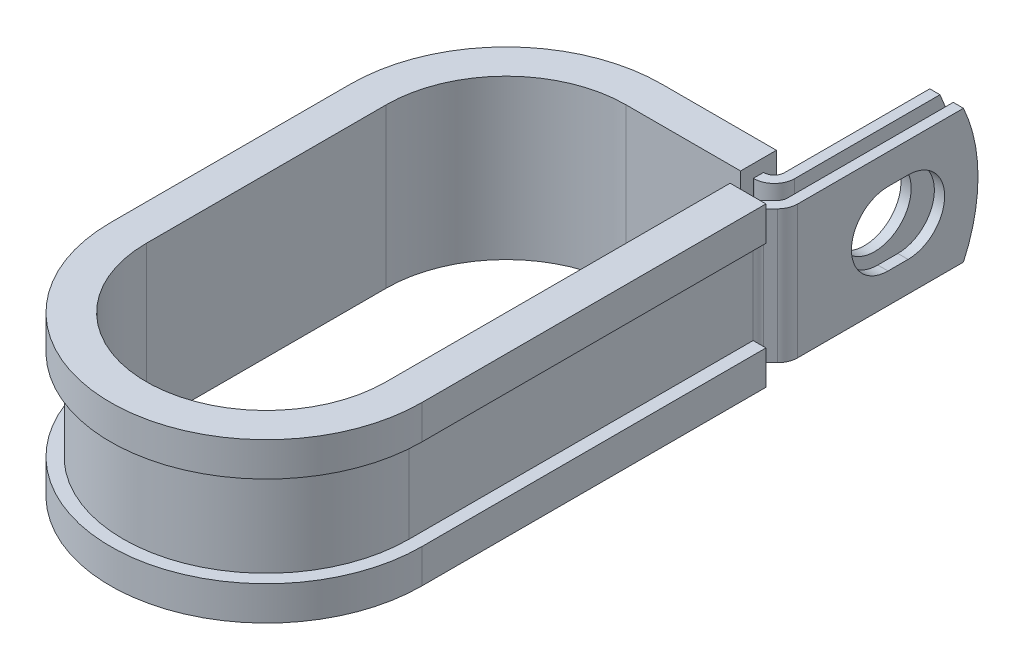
ISO-10303-21;
HEADER;
FILE_DESCRIPTION(('STEP AP214'),'2;1');
FILE_NAME('part.step','',(''),(''),'','','');
FILE_SCHEMA(('AUTOMOTIVE_DESIGN { 1 0 10303 214 1 1 1 1 }'));
ENDSEC;
DATA;
#1=APPLICATION_CONTEXT('core data for automotive mechanical design processes');
#2=APPLICATION_PROTOCOL_DEFINITION('international standard','automotive_design',2000,#1);
#3=PRODUCT_CONTEXT('',#1,'mechanical');
#4=PRODUCT('Part','Part','',(#3));
#5=PRODUCT_RELATED_PRODUCT_CATEGORY('part','',(#4));
#6=PRODUCT_DEFINITION_FORMATION('','',#4);
#7=PRODUCT_DEFINITION_CONTEXT('part definition',#1,'design');
#8=PRODUCT_DEFINITION('design','',#6,#7);
#9=PRODUCT_DEFINITION_SHAPE('','',#8);
#10=(LENGTH_UNIT() NAMED_UNIT(*) SI_UNIT(.MILLI.,.METRE.));
#11=(NAMED_UNIT(*) PLANE_ANGLE_UNIT() SI_UNIT($,.RADIAN.));
#12=(NAMED_UNIT(*) SI_UNIT($,.STERADIAN.) SOLID_ANGLE_UNIT());
#13=UNCERTAINTY_MEASURE_WITH_UNIT(LENGTH_MEASURE(1.E-05),#10,'distance_accuracy_value','');
#14=(GEOMETRIC_REPRESENTATION_CONTEXT(3) GLOBAL_UNCERTAINTY_ASSIGNED_CONTEXT((#13)) GLOBAL_UNIT_ASSIGNED_CONTEXT((#10,
#11,#12)) REPRESENTATION_CONTEXT('',''));
#15=CARTESIAN_POINT('',(0.,0.,0.));
#16=DIRECTION('',(0.,0.,1.));
#17=DIRECTION('',(1.,0.,0.));
#18=AXIS2_PLACEMENT_3D('',#15,#16,#17);
#19=CARTESIAN_POINT('',(16.4897698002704,-7.9375,-15.8115));
#20=DIRECTION('',(0.,1.,0.));
#21=DIRECTION('',(1.,0.,0.));
#22=AXIS2_PLACEMENT_3D('',#19,#20,#21);
#23=PLANE('',#22);
#24=DIRECTION('',(0.,0.,-1.));
#25=VECTOR('',#24,1.);
#26=CARTESIAN_POINT('',(13.6449698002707,-7.9375,-15.8115));
#27=LINE('',#26,#25);
#28=CARTESIAN_POINT('',(13.6449698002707,-7.9375,-15.8115));
#29=VERTEX_POINT('',#28);
#30=CARTESIAN_POINT('',(13.6449698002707,-7.9375,-17.0307));
#31=VERTEX_POINT('',#30);
#32=EDGE_CURVE('E582',#29,#31,#27,.T.);
#33=ORIENTED_EDGE('',*,*,#32,.T.);
#34=DIRECTION('',(1.,0.,0.));
#35=VECTOR('',#34,1.);
#36=CARTESIAN_POINT('',(0.,-7.9375,-17.0307));
#37=LINE('',#36,#35);
#38=CARTESIAN_POINT('',(13.6957698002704,-7.9375,-17.0307));
#39=VERTEX_POINT('',#38);
#40=EDGE_CURVE('E416',#39,#31,#37,.F.);
#41=ORIENTED_EDGE('',*,*,#40,.F.);
#42=CARTESIAN_POINT('',(13.6957698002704,-7.9375,-18.2499));
#43=DIRECTION('',(0.,1.,0.));
#44=DIRECTION('',(1.,0.,0.));
#45=AXIS2_PLACEMENT_3D('',#42,#43,#44);
#46=CIRCLE('',#45,1.2192);
#47=CARTESIAN_POINT('',(14.9149698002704,-7.9375,-18.2499));
#48=VERTEX_POINT('',#47);
#49=EDGE_CURVE('E414',#48,#39,#46,.F.);
#50=ORIENTED_EDGE('',*,*,#49,.F.);
#51=DIRECTION('',(0.,0.,1.));
#52=VECTOR('',#51,1.);
#53=CARTESIAN_POINT('',(14.9149698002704,-7.9375,-37.2872));
#54=LINE('',#53,#52);
#55=CARTESIAN_POINT('',(14.9149698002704,-7.9375,-35.5547804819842));
#56=VERTEX_POINT('',#55);
#57=EDGE_CURVE('E412',#56,#48,#54,.T.);
#58=ORIENTED_EDGE('',*,*,#57,.F.);
#59=DIRECTION('',(-1.,0.,0.));
#60=VECTOR('',#59,1.);
#61=CARTESIAN_POINT('',(18.9281698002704,-7.9375,-35.5547804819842));
#62=LINE('',#61,#60);
#63=CARTESIAN_POINT('',(16.1341698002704,-7.9375,-35.5547804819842));
#64=VERTEX_POINT('',#63);
#65=EDGE_CURVE('E12',#64,#56,#62,.T.);
#66=ORIENTED_EDGE('',*,*,#65,.F.);
#67=DIRECTION('',(0.,0.,1.));
#68=VECTOR('',#67,1.);
#69=CARTESIAN_POINT('',(16.1341698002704,-7.9375,-37.2872));
#70=LINE('',#69,#68);
#71=CARTESIAN_POINT('',(16.1341698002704,-7.9375,-18.2499));
#72=VERTEX_POINT('',#71);
#73=EDGE_CURVE('E410',#64,#72,#70,.T.);
#74=ORIENTED_EDGE('',*,*,#73,.T.);
#75=CARTESIAN_POINT('',(13.6957698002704,-7.9375,-18.2499));
#76=DIRECTION('',(0.,-1.,0.));
#77=DIRECTION('',(0.,0.,1.));
#78=AXIS2_PLACEMENT_3D('',#75,#76,#77);
#79=CIRCLE('',#78,2.4384);
#80=CARTESIAN_POINT('',(13.6957698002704,-7.9375,-15.8115));
#81=VERTEX_POINT('',#80);
#82=EDGE_CURVE('E407',#72,#81,#79,.T.);
#83=ORIENTED_EDGE('',*,*,#82,.T.);
#84=DIRECTION('',(-1.,0.,0.));
#85=VECTOR('',#84,1.);
#86=CARTESIAN_POINT('',(0.,-7.9375,-15.8115));
#87=LINE('',#86,#85);
#88=EDGE_CURVE('E404',#81,#29,#87,.T.);
#89=ORIENTED_EDGE('',*,*,#88,.T.);
#90=EDGE_LOOP('',(#33,#41,#50,#58,#66,#74,#83,#89));
#91=FACE_BOUND('',#90,.T.);
#92=ADVANCED_FACE('F55',(#91),#23,.F.);
#93=CARTESIAN_POINT('',(16.4897698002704,7.9375,-15.8115));
#94=DIRECTION('',(0.,1.,0.));
#95=DIRECTION('',(1.,0.,0.));
#96=AXIS2_PLACEMENT_3D('',#93,#94,#95);
#97=PLANE('',#96);
#98=DIRECTION('',(1.,0.,0.));
#99=VECTOR('',#98,1.);
#100=CARTESIAN_POINT('',(0.,7.9375,-17.0307));
#101=LINE('',#100,#99);
#102=CARTESIAN_POINT('',(13.6957698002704,7.9375,-17.0307));
#103=VERTEX_POINT('',#102);
#104=CARTESIAN_POINT('',(13.6449698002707,7.9375,-17.0307));
#105=VERTEX_POINT('',#104);
#106=EDGE_CURVE('E377',#103,#105,#101,.F.);
#107=ORIENTED_EDGE('',*,*,#106,.T.);
#108=DIRECTION('',(0.,0.,1.));
#109=VECTOR('',#108,1.);
#110=CARTESIAN_POINT('',(13.6449698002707,7.9375,-17.0307));
#111=LINE('',#110,#109);
#112=CARTESIAN_POINT('',(13.6449698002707,7.9375,-15.8115));
#113=VERTEX_POINT('',#112);
#114=EDGE_CURVE('E588',#105,#113,#111,.T.);
#115=ORIENTED_EDGE('',*,*,#114,.T.);
#116=DIRECTION('',(-1.,0.,0.));
#117=VECTOR('',#116,1.);
#118=CARTESIAN_POINT('',(0.,7.9375,-15.8115));
#119=LINE('',#118,#117);
#120=CARTESIAN_POINT('',(13.6957698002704,7.9375,-15.8115));
#121=VERTEX_POINT('',#120);
#122=EDGE_CURVE('E479',#121,#113,#119,.T.);
#123=ORIENTED_EDGE('',*,*,#122,.F.);
#124=CARTESIAN_POINT('',(13.6957698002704,7.9375,-18.2499));
#125=DIRECTION('',(0.,-1.,0.));
#126=DIRECTION('',(0.,0.,1.));
#127=AXIS2_PLACEMENT_3D('',#124,#125,#126);
#128=CIRCLE('',#127,2.4384);
#129=CARTESIAN_POINT('',(16.1341698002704,7.9375,-18.2499));
#130=VERTEX_POINT('',#129);
#131=EDGE_CURVE('E474',#130,#121,#128,.T.);
#132=ORIENTED_EDGE('',*,*,#131,.F.);
#133=DIRECTION('',(0.,0.,1.));
#134=VECTOR('',#133,1.);
#135=CARTESIAN_POINT('',(16.1341698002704,7.9375,-37.2872));
#136=LINE('',#135,#134);
#137=CARTESIAN_POINT('',(16.1341698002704,7.9375,-35.5547804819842));
#138=VERTEX_POINT('',#137);
#139=EDGE_CURVE('E468',#138,#130,#136,.T.);
#140=ORIENTED_EDGE('',*,*,#139,.F.);
#141=DIRECTION('',(-1.,0.,0.));
#142=VECTOR('',#141,1.);
#143=CARTESIAN_POINT('',(18.9281698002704,7.9375,-35.5547804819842));
#144=LINE('',#143,#142);
#145=CARTESIAN_POINT('',(14.9149698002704,7.9375,-35.5547804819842));
#146=VERTEX_POINT('',#145);
#147=EDGE_CURVE('E63',#138,#146,#144,.T.);
#148=ORIENTED_EDGE('',*,*,#147,.T.);
#149=DIRECTION('',(0.,0.,1.));
#150=VECTOR('',#149,1.);
#151=CARTESIAN_POINT('',(14.9149698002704,7.9375,-37.2872));
#152=LINE('',#151,#150);
#153=CARTESIAN_POINT('',(14.9149698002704,7.9375,-18.2499));
#154=VERTEX_POINT('',#153);
#155=EDGE_CURVE('E465',#146,#154,#152,.T.);
#156=ORIENTED_EDGE('',*,*,#155,.T.);
#157=CARTESIAN_POINT('',(13.6957698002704,7.9375,-18.2499));
#158=DIRECTION('',(0.,1.,0.));
#159=DIRECTION('',(1.,0.,0.));
#160=AXIS2_PLACEMENT_3D('',#157,#158,#159);
#161=CIRCLE('',#160,1.2192);
#162=EDGE_CURVE('E382',#154,#103,#161,.F.);
#163=ORIENTED_EDGE('',*,*,#162,.T.);
#164=EDGE_LOOP('',(#107,#115,#123,#132,#140,#148,#156,#163));
#165=FACE_BOUND('',#164,.T.);
#166=ADVANCED_FACE('F464',(#165),#97,.T.);
#167=CARTESIAN_POINT('',(0.,7.9375,-15.8115));
#168=DIRECTION('',(0.,0.,1.));
#169=DIRECTION('',(1.,0.,0.));
#170=AXIS2_PLACEMENT_3D('',#167,#168,#169);
#171=PLANE('',#170);
#172=ORIENTED_EDGE('',*,*,#122,.T.);
#173=DIRECTION('',(0.,-1.,0.));
#174=VECTOR('',#173,1.);
#175=CARTESIAN_POINT('',(13.6449698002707,7.9375,-15.8115));
#176=LINE('',#175,#174);
#177=EDGE_CURVE('E585',#113,#29,#176,.T.);
#178=ORIENTED_EDGE('',*,*,#177,.T.);
#179=ORIENTED_EDGE('',*,*,#88,.F.);
#180=DIRECTION('',(0.,-1.,0.));
#181=VECTOR('',#180,1.);
#182=CARTESIAN_POINT('',(13.6957698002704,7.9375,-15.8115));
#183=LINE('',#182,#181);
#184=EDGE_CURVE('E452',#121,#81,#183,.T.);
#185=ORIENTED_EDGE('',*,*,#184,.F.);
#186=EDGE_LOOP('',(#172,#178,#179,#185));
#187=FACE_BOUND('',#186,.T.);
#188=ADVANCED_FACE('F789',(#187),#171,.T.);
#189=CARTESIAN_POINT('',(18.9281698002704,7.9375,-15.8115));
#190=DIRECTION('',(-1.,0.,0.));
#191=DIRECTION('',(0.,0.,1.));
#192=AXIS2_PLACEMENT_3D('',#189,#190,#191);
#193=PLANE('',#192);
#194=CARTESIAN_POINT('',(18.9281698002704,0.,-28.9559999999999));
#195=DIRECTION('',(1.,0.,0.));
#196=DIRECTION('',(0.,0.,-1.));
#197=AXIS2_PLACEMENT_3D('',#194,#195,#196);
#198=CIRCLE('',#197,4.3561);
#199=CARTESIAN_POINT('',(18.9281698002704,-4.3561,-28.9560000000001));
#200=VERTEX_POINT('',#199);
#201=CARTESIAN_POINT('',(18.9281698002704,4.3561,-28.9560000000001));
#202=VERTEX_POINT('',#201);
#203=EDGE_CURVE('E527',#200,#202,#198,.T.);
#204=ORIENTED_EDGE('',*,*,#203,.F.);
#205=DIRECTION('',(0.,0.,-1.));
#206=VECTOR('',#205,1.);
#207=CARTESIAN_POINT('',(18.9281698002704,-4.3561,-26.5683999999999));
#208=LINE('',#207,#206);
#209=CARTESIAN_POINT('',(18.9281698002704,-4.3561,-26.5683999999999));
#210=VERTEX_POINT('',#209);
#211=EDGE_CURVE('E524',#210,#200,#208,.T.);
#212=ORIENTED_EDGE('',*,*,#211,.F.);
#213=CARTESIAN_POINT('',(18.9281698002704,0.,-26.5683999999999));
#214=DIRECTION('',(1.,0.,0.));
#215=DIRECTION('',(0.,0.,-1.));
#216=AXIS2_PLACEMENT_3D('',#213,#214,#215);
#217=CIRCLE('',#216,4.3561);
#218=CARTESIAN_POINT('',(18.9281698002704,4.3561,-26.5683999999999));
#219=VERTEX_POINT('',#218);
#220=EDGE_CURVE('E521',#219,#210,#217,.T.);
#221=ORIENTED_EDGE('',*,*,#220,.F.);
#222=DIRECTION('',(0.,0.,1.));
#223=VECTOR('',#222,1.);
#224=CARTESIAN_POINT('',(18.9281698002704,4.3561,-26.5683999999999));
#225=LINE('',#224,#223);
#226=EDGE_CURVE('E520',#202,#219,#225,.T.);
#227=ORIENTED_EDGE('',*,*,#226,.F.);
#228=EDGE_LOOP('',(#204,#212,#221,#227));
#229=FACE_BOUND('',#228,.T.);
#230=DIRECTION('',(0.,0.,-1.));
#231=VECTOR('',#230,1.);
#232=CARTESIAN_POINT('',(18.9281698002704,-7.9375,-15.8115));
#233=LINE('',#232,#231);
#234=CARTESIAN_POINT('',(18.9281698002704,-7.9375,-15.8115));
#235=VERTEX_POINT('',#234);
#236=CARTESIAN_POINT('',(18.9281698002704,-7.9375,-35.5547804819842));
#237=VERTEX_POINT('',#236);
#238=EDGE_CURVE('E388',#235,#237,#233,.T.);
#239=ORIENTED_EDGE('',*,*,#238,.T.);
#240=CARTESIAN_POINT('',(18.9281698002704,0.,-18.2372));
#241=DIRECTION('',(-1.,0.,0.));
#242=DIRECTION('',(0.,0.,1.));
#243=AXIS2_PLACEMENT_3D('',#240,#241,#242);
#244=CIRCLE('',#243,19.05);
#245=CARTESIAN_POINT('',(18.9281698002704,7.9375,-35.5547804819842));
#246=VERTEX_POINT('',#245);
#247=EDGE_CURVE('E536',#246,#237,#244,.T.);
#248=ORIENTED_EDGE('',*,*,#247,.F.);
#249=DIRECTION('',(0.,0.,-1.));
#250=VECTOR('',#249,1.);
#251=CARTESIAN_POINT('',(18.9281698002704,7.9375,-15.8115));
#252=LINE('',#251,#250);
#253=CARTESIAN_POINT('',(18.9281698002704,7.9375,-15.8115));
#254=VERTEX_POINT('',#253);
#255=EDGE_CURVE('E425',#254,#246,#252,.T.);
#256=ORIENTED_EDGE('',*,*,#255,.F.);
#257=DIRECTION('',(0.,-1.,0.));
#258=VECTOR('',#257,1.);
#259=CARTESIAN_POINT('',(18.9281698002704,7.9375,-15.8115));
#260=LINE('',#259,#258);
#261=EDGE_CURVE('E387',#254,#235,#260,.T.);
#262=ORIENTED_EDGE('',*,*,#261,.T.);
#263=EDGE_LOOP('',(#239,#248,#256,#262));
#264=FACE_BOUND('',#263,.T.);
#265=ADVANCED_FACE('F57',(#229,#264),#193,.F.);
#266=CARTESIAN_POINT('',(17.7089698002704,7.9375,-15.8115));
#267=DIRECTION('',(-1.,0.,0.));
#268=DIRECTION('',(0.,0.,1.));
#269=AXIS2_PLACEMENT_3D('',#266,#267,#268);
#270=PLANE('',#269);
#271=DIRECTION('',(0.,0.,-1.));
#272=VECTOR('',#271,1.);
#273=CARTESIAN_POINT('',(17.7089698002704,-4.3561,-26.5683999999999));
#274=LINE('',#273,#272);
#275=CARTESIAN_POINT('',(17.7089698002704,-4.3561,-26.5683999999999));
#276=VERTEX_POINT('',#275);
#277=CARTESIAN_POINT('',(17.7089698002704,-4.3561,-28.9560000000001));
#278=VERTEX_POINT('',#277);
#279=EDGE_CURVE('E505',#276,#278,#274,.T.);
#280=ORIENTED_EDGE('',*,*,#279,.T.);
#281=CARTESIAN_POINT('',(17.7089698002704,0.,-28.9559999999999));
#282=DIRECTION('',(-1.,0.,0.));
#283=DIRECTION('',(0.,0.,1.));
#284=AXIS2_PLACEMENT_3D('',#281,#282,#283);
#285=CIRCLE('',#284,4.3561);
#286=CARTESIAN_POINT('',(17.7089698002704,4.3561,-28.9560000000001));
#287=VERTEX_POINT('',#286);
#288=EDGE_CURVE('E504',#278,#287,#285,.F.);
#289=ORIENTED_EDGE('',*,*,#288,.T.);
#290=DIRECTION('',(0.,0.,1.));
#291=VECTOR('',#290,1.);
#292=CARTESIAN_POINT('',(17.7089698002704,4.3561,-26.5683999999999));
#293=LINE('',#292,#291);
#294=CARTESIAN_POINT('',(17.7089698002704,4.3561,-26.5683999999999));
#295=VERTEX_POINT('',#294);
#296=EDGE_CURVE('E508',#287,#295,#293,.T.);
#297=ORIENTED_EDGE('',*,*,#296,.T.);
#298=CARTESIAN_POINT('',(17.7089698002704,0.,-26.5683999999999));
#299=DIRECTION('',(-1.,0.,0.));
#300=DIRECTION('',(0.,0.,1.));
#301=AXIS2_PLACEMENT_3D('',#298,#299,#300);
#302=CIRCLE('',#301,4.3561);
#303=EDGE_CURVE('E501',#295,#276,#302,.F.);
#304=ORIENTED_EDGE('',*,*,#303,.T.);
#305=EDGE_LOOP('',(#280,#289,#297,#304));
#306=FACE_BOUND('',#305,.T.);
#307=CARTESIAN_POINT('',(17.7089698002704,0.,-18.2372));
#308=DIRECTION('',(-1.,0.,0.));
#309=DIRECTION('',(0.,0.,1.));
#310=AXIS2_PLACEMENT_3D('',#307,#308,#309);
#311=CIRCLE('',#310,19.05);
#312=CARTESIAN_POINT('',(17.7089698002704,7.9375,-35.5547804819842));
#313=VERTEX_POINT('',#312);
#314=CARTESIAN_POINT('',(17.7089698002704,-7.9375,-35.5547804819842));
#315=VERTEX_POINT('',#314);
#316=EDGE_CURVE('E77',#313,#315,#311,.T.);
#317=ORIENTED_EDGE('',*,*,#316,.T.);
#318=DIRECTION('',(0.,0.,-1.));
#319=VECTOR('',#318,1.);
#320=CARTESIAN_POINT('',(17.7089698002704,-7.9375,-15.8115));
#321=LINE('',#320,#319);
#322=CARTESIAN_POINT('',(17.7089698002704,-7.9375,-15.8115));
#323=VERTEX_POINT('',#322);
#324=EDGE_CURVE('E391',#323,#315,#321,.T.);
#325=ORIENTED_EDGE('',*,*,#324,.F.);
#326=DIRECTION('',(0.,-1.,0.));
#327=VECTOR('',#326,1.);
#328=CARTESIAN_POINT('',(17.7089698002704,7.9375,-15.8115));
#329=LINE('',#328,#327);
#330=CARTESIAN_POINT('',(17.7089698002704,7.9375,-15.8115));
#331=VERTEX_POINT('',#330);
#332=EDGE_CURVE('E460',#331,#323,#329,.T.);
#333=ORIENTED_EDGE('',*,*,#332,.F.);
#334=DIRECTION('',(0.,0.,-1.));
#335=VECTOR('',#334,1.);
#336=CARTESIAN_POINT('',(17.7089698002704,7.9375,-15.8115));
#337=LINE('',#336,#335);
#338=EDGE_CURVE('E489',#331,#313,#337,.T.);
#339=ORIENTED_EDGE('',*,*,#338,.T.);
#340=EDGE_LOOP('',(#317,#325,#333,#339));
#341=FACE_BOUND('',#340,.T.);
#342=ADVANCED_FACE('F762',(#306,#341),#270,.T.);
#343=CARTESIAN_POINT('',(16.1341698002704,7.9375,-37.2872));
#344=DIRECTION('',(1.,0.,0.));
#345=DIRECTION('',(0.,0.,-1.));
#346=AXIS2_PLACEMENT_3D('',#343,#344,#345);
#347=PLANE('',#346);
#348=CARTESIAN_POINT('',(16.1341698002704,0.,-27.7622));
#349=DIRECTION('',(1.,0.,0.));
#350=DIRECTION('',(0.,0.,-1.));
#351=AXIS2_PLACEMENT_3D('',#348,#349,#350);
#352=CIRCLE('',#351,4.3561);
#353=CARTESIAN_POINT('',(16.1341698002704,0.,-32.1183));
#354=VERTEX_POINT('',#353);
#355=EDGE_CURVE('E392',#354,#354,#352,.F.);
#356=ORIENTED_EDGE('',*,*,#355,.T.);
#357=EDGE_LOOP('',(#356));
#358=FACE_BOUND('',#357,.T.);
#359=ORIENTED_EDGE('',*,*,#73,.F.);
#360=CARTESIAN_POINT('',(16.1341698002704,0.,-18.2372));
#361=DIRECTION('',(1.,0.,0.));
#362=DIRECTION('',(0.,0.,-1.));
#363=AXIS2_PLACEMENT_3D('',#360,#361,#362);
#364=CIRCLE('',#363,19.05);
#365=EDGE_CURVE('E532',#64,#138,#364,.T.);
#366=ORIENTED_EDGE('',*,*,#365,.T.);
#367=ORIENTED_EDGE('',*,*,#139,.T.);
#368=DIRECTION('',(0.,-1.,0.));
#369=VECTOR('',#368,1.);
#370=CARTESIAN_POINT('',(16.1341698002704,7.9375,-18.2499));
#371=LINE('',#370,#369);
#372=EDGE_CURVE('E449',#130,#72,#371,.T.);
#373=ORIENTED_EDGE('',*,*,#372,.T.);
#374=EDGE_LOOP('',(#359,#366,#367,#373));
#375=FACE_BOUND('',#374,.T.);
#376=ADVANCED_FACE('F797',(#358,#375),#347,.T.);
#377=CARTESIAN_POINT('',(14.9149698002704,7.9375,-37.2872));
#378=DIRECTION('',(1.,0.,0.));
#379=DIRECTION('',(0.,0.,-1.));
#380=AXIS2_PLACEMENT_3D('',#377,#378,#379);
#381=PLANE('',#380);
#382=CARTESIAN_POINT('',(14.9149698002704,0.,-27.7622));
#383=DIRECTION('',(-1.,0.,0.));
#384=DIRECTION('',(0.,0.,1.));
#385=AXIS2_PLACEMENT_3D('',#382,#383,#384);
#386=CIRCLE('',#385,4.3561);
#387=CARTESIAN_POINT('',(14.9149698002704,0.,-23.4061));
#388=VERTEX_POINT('',#387);
#389=EDGE_CURVE('E496',#388,#388,#386,.T.);
#390=ORIENTED_EDGE('',*,*,#389,.F.);
#391=EDGE_LOOP('',(#390));
#392=FACE_BOUND('',#391,.T.);
#393=CARTESIAN_POINT('',(14.9149698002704,0.,-18.2372));
#394=DIRECTION('',(-1.,0.,0.));
#395=DIRECTION('',(0.,0.,1.));
#396=AXIS2_PLACEMENT_3D('',#393,#394,#395);
#397=CIRCLE('',#396,19.05);
#398=EDGE_CURVE('E69',#146,#56,#397,.T.);
#399=ORIENTED_EDGE('',*,*,#398,.T.);
#400=ORIENTED_EDGE('',*,*,#57,.T.);
#401=DIRECTION('',(0.,-1.,0.));
#402=VECTOR('',#401,1.);
#403=CARTESIAN_POINT('',(14.9149698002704,7.9375,-18.2499));
#404=LINE('',#403,#402);
#405=EDGE_CURVE('E446',#154,#48,#404,.T.);
#406=ORIENTED_EDGE('',*,*,#405,.F.);
#407=ORIENTED_EDGE('',*,*,#155,.F.);
#408=EDGE_LOOP('',(#399,#400,#406,#407));
#409=FACE_BOUND('',#408,.T.);
#410=ADVANCED_FACE('F471',(#392,#409),#381,.F.);
#411=CARTESIAN_POINT('',(18.2499,-7.9375,-12.3990026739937));
#412=DIRECTION('',(0.,1.,0.));
#413=DIRECTION('',(1.,0.,0.));
#414=AXIS2_PLACEMENT_3D('',#411,#412,#413);
#415=CIRCLE('',#414,1.2192);
#416=CARTESIAN_POINT('',(17.0307,-7.9375,-12.3990026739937));
#417=VERTEX_POINT('',#416);
#418=CARTESIAN_POINT('',(17.3877954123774,-7.9375,-13.2611072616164));
#419=VERTEX_POINT('',#418);
#420=EDGE_CURVE('E419',#417,#419,#415,.F.);
#421=ORIENTED_EDGE('',*,*,#420,.F.);
#422=DIRECTION('',(1.,0.,0.));
#423=VECTOR('',#422,1.);
#424=CARTESIAN_POINT('',(15.8115,-7.9375,-12.3990026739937));
#425=LINE('',#424,#423);
#426=CARTESIAN_POINT('',(15.8115,-7.9375,-12.3990026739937));
#427=VERTEX_POINT('',#426);
#428=EDGE_CURVE('E370',#427,#417,#425,.T.);
#429=ORIENTED_EDGE('',*,*,#428,.F.);
#430=CARTESIAN_POINT('',(18.2499,-7.9375,-12.3990026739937));
#431=DIRECTION('',(0.,-1.,0.));
#432=DIRECTION('',(0.,0.,1.));
#433=AXIS2_PLACEMENT_3D('',#430,#431,#432);
#434=CIRCLE('',#433,2.4384);
#435=CARTESIAN_POINT('',(16.5256908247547,-7.9375,-14.123211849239));
#436=VERTEX_POINT('',#435);
#437=EDGE_CURVE('E401',#427,#436,#434,.T.);
#438=ORIENTED_EDGE('',*,*,#437,.T.);
#439=DIRECTION('',(0.707106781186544,0.,-0.707106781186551));
#440=VECTOR('',#439,1.);
#441=CARTESIAN_POINT('',(16.5256908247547,-7.9375,-14.123211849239));
#442=LINE('',#441,#440);
#443=CARTESIAN_POINT('',(17.3518743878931,-7.9375,-14.9493954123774));
#444=VERTEX_POINT('',#443);
#445=EDGE_CURVE('E398',#436,#444,#442,.T.);
#446=ORIENTED_EDGE('',*,*,#445,.T.);
#447=CARTESIAN_POINT('',(16.4897698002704,-7.9375,-15.8115));
#448=DIRECTION('',(0.,1.,0.));
#449=DIRECTION('',(0.,0.,1.));
#450=AXIS2_PLACEMENT_3D('',#447,#448,#449);
#451=CIRCLE('',#450,1.2192);
#452=EDGE_CURVE('E395',#444,#323,#451,.T.);
#453=ORIENTED_EDGE('',*,*,#452,.T.);
#454=ORIENTED_EDGE('',*,*,#324,.T.);
#455=DIRECTION('',(-1.,0.,0.));
#456=VECTOR('',#455,1.);
#457=CARTESIAN_POINT('',(18.9281698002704,-7.9375,-35.5547804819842));
#458=LINE('',#457,#456);
#459=EDGE_CURVE('E538',#237,#315,#458,.T.);
#460=ORIENTED_EDGE('',*,*,#459,.F.);
#461=ORIENTED_EDGE('',*,*,#238,.F.);
#462=CARTESIAN_POINT('',(16.4897698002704,-7.9375,-15.8115));
#463=DIRECTION('',(0.,1.,0.));
#464=DIRECTION('',(1.,0.,0.));
#465=AXIS2_PLACEMENT_3D('',#462,#463,#464);
#466=CIRCLE('',#465,2.4384);
#467=CARTESIAN_POINT('',(18.2139789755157,-7.9375,-14.0872908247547));
#468=VERTEX_POINT('',#467);
#469=EDGE_CURVE('E423',#468,#235,#466,.T.);
#470=ORIENTED_EDGE('',*,*,#469,.F.);
#471=DIRECTION('',(0.707106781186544,0.,-0.707106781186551));
#472=VECTOR('',#471,1.);
#473=CARTESIAN_POINT('',(17.3877954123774,-7.9375,-13.2611072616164));
#474=LINE('',#473,#472);
#475=EDGE_CURVE('E421',#419,#468,#474,.T.);
#476=ORIENTED_EDGE('',*,*,#475,.F.);
#477=EDGE_LOOP('',(#421,#429,#438,#446,#453,#454,#460,#461,#470,#476));
#478=FACE_BOUND('',#477,.T.);
#479=ADVANCED_FACE('F743',(#478),#23,.F.);
#480=DIRECTION('',(-1.,0.,0.));
#481=VECTOR('',#480,1.);
#482=CARTESIAN_POINT('',(17.0307,7.9375,-12.3990026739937));
#483=LINE('',#482,#481);
#484=CARTESIAN_POINT('',(17.0307,7.9375,-12.3990026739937));
#485=VERTEX_POINT('',#484);
#486=CARTESIAN_POINT('',(15.8115,7.9375,-12.3990026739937));
#487=VERTEX_POINT('',#486);
#488=EDGE_CURVE('E350',#485,#487,#483,.T.);
#489=ORIENTED_EDGE('',*,*,#488,.F.);
#490=CARTESIAN_POINT('',(18.2499,7.9375,-12.3990026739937));
#491=DIRECTION('',(0.,1.,0.));
#492=DIRECTION('',(1.,0.,0.));
#493=AXIS2_PLACEMENT_3D('',#490,#491,#492);
#494=CIRCLE('',#493,1.2192);
#495=CARTESIAN_POINT('',(17.3877954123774,7.9375,-13.2611072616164));
#496=VERTEX_POINT('',#495);
#497=EDGE_CURVE('E365',#485,#496,#494,.F.);
#498=ORIENTED_EDGE('',*,*,#497,.T.);
#499=DIRECTION('',(0.707106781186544,0.,-0.707106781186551));
#500=VECTOR('',#499,1.);
#501=CARTESIAN_POINT('',(17.3877954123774,7.9375,-13.2611072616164));
#502=LINE('',#501,#500);
#503=CARTESIAN_POINT('',(18.2139789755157,7.9375,-14.0872908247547));
#504=VERTEX_POINT('',#503);
#505=EDGE_CURVE('E376',#496,#504,#502,.T.);
#506=ORIENTED_EDGE('',*,*,#505,.T.);
#507=CARTESIAN_POINT('',(16.4897698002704,7.9375,-15.8115));
#508=DIRECTION('',(0.,1.,0.));
#509=DIRECTION('',(1.,0.,0.));
#510=AXIS2_PLACEMENT_3D('',#507,#508,#509);
#511=CIRCLE('',#510,2.4384);
#512=EDGE_CURVE('E379',#504,#254,#511,.T.);
#513=ORIENTED_EDGE('',*,*,#512,.T.);
#514=ORIENTED_EDGE('',*,*,#255,.T.);
#515=DIRECTION('',(-1.,0.,0.));
#516=VECTOR('',#515,1.);
#517=CARTESIAN_POINT('',(18.9281698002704,7.9375,-35.5547804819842));
#518=LINE('',#517,#516);
#519=EDGE_CURVE('E534',#246,#313,#518,.T.);
#520=ORIENTED_EDGE('',*,*,#519,.T.);
#521=ORIENTED_EDGE('',*,*,#338,.F.);
#522=CARTESIAN_POINT('',(16.4897698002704,7.9375,-15.8115));
#523=DIRECTION('',(0.,1.,0.));
#524=DIRECTION('',(0.,0.,1.));
#525=AXIS2_PLACEMENT_3D('',#522,#523,#524);
#526=CIRCLE('',#525,1.2192);
#527=CARTESIAN_POINT('',(17.3518743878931,7.9375,-14.9493954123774));
#528=VERTEX_POINT('',#527);
#529=EDGE_CURVE('E486',#528,#331,#526,.T.);
#530=ORIENTED_EDGE('',*,*,#529,.F.);
#531=DIRECTION('',(0.707106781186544,0.,-0.707106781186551));
#532=VECTOR('',#531,1.);
#533=CARTESIAN_POINT('',(16.5256908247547,7.9375,-14.123211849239));
#534=LINE('',#533,#532);
#535=CARTESIAN_POINT('',(16.5256908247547,7.9375,-14.123211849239));
#536=VERTEX_POINT('',#535);
#537=EDGE_CURVE('E483',#536,#528,#534,.T.);
#538=ORIENTED_EDGE('',*,*,#537,.F.);
#539=CARTESIAN_POINT('',(18.2499,7.9375,-12.3990026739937));
#540=DIRECTION('',(0.,-1.,0.));
#541=DIRECTION('',(0.,0.,1.));
#542=AXIS2_PLACEMENT_3D('',#539,#540,#541);
#543=CIRCLE('',#542,2.4384);
#544=EDGE_CURVE('E369',#487,#536,#543,.T.);
#545=ORIENTED_EDGE('',*,*,#544,.F.);
#546=EDGE_LOOP('',(#489,#498,#506,#513,#514,#520,#521,#530,#538,#545));
#547=FACE_BOUND('',#546,.T.);
#548=ADVANCED_FACE('F364',(#547),#97,.T.);
#549=CARTESIAN_POINT('',(16.4897698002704,7.9375,-15.8115));
#550=DIRECTION('',(0.,-1.,0.));
#551=DIRECTION('',(0.,0.,-1.));
#552=AXIS2_PLACEMENT_3D('',#549,#550,#551);
#553=CYLINDRICAL_SURFACE('',#552,1.2192);
#554=ORIENTED_EDGE('',*,*,#452,.F.);
#555=DIRECTION('',(0.,-1.,0.));
#556=VECTOR('',#555,1.);
#557=CARTESIAN_POINT('',(17.3518743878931,7.9375,-14.9493954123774));
#558=LINE('',#557,#556);
#559=EDGE_CURVE('E458',#528,#444,#558,.T.);
#560=ORIENTED_EDGE('',*,*,#559,.F.);
#561=ORIENTED_EDGE('',*,*,#529,.T.);
#562=ORIENTED_EDGE('',*,*,#332,.T.);
#563=EDGE_LOOP('',(#554,#560,#561,#562));
#564=FACE_BOUND('',#563,.T.);
#565=ADVANCED_FACE('F765',(#564),#553,.F.);
#566=CARTESIAN_POINT('',(16.5256908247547,7.9375,-14.123211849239));
#567=DIRECTION('',(-0.707106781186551,0.,-0.707106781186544));
#568=DIRECTION('',(-0.707106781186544,0.,0.707106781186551));
#569=AXIS2_PLACEMENT_3D('',#566,#567,#568);
#570=PLANE('',#569);
#571=ORIENTED_EDGE('',*,*,#445,.F.);
#572=DIRECTION('',(0.,-1.,0.));
#573=VECTOR('',#572,1.);
#574=CARTESIAN_POINT('',(16.5256908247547,7.9375,-14.123211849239));
#575=LINE('',#574,#573);
#576=EDGE_CURVE('E456',#536,#436,#575,.T.);
#577=ORIENTED_EDGE('',*,*,#576,.F.);
#578=ORIENTED_EDGE('',*,*,#537,.T.);
#579=ORIENTED_EDGE('',*,*,#559,.T.);
#580=EDGE_LOOP('',(#571,#577,#578,#579));
#581=FACE_BOUND('',#580,.T.);
#582=ADVANCED_FACE('F768',(#581),#570,.T.);
#583=CARTESIAN_POINT('',(18.2499,7.9375,-12.3990026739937));
#584=DIRECTION('',(0.,-1.,0.));
#585=DIRECTION('',(0.,0.,-1.));
#586=AXIS2_PLACEMENT_3D('',#583,#584,#585);
#587=CYLINDRICAL_SURFACE('',#586,2.4384);
#588=ORIENTED_EDGE('',*,*,#437,.F.);
#589=DIRECTION('',(0.,-1.,0.));
#590=VECTOR('',#589,1.);
#591=CARTESIAN_POINT('',(15.8115,7.9375,-12.3990026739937));
#592=LINE('',#591,#590);
#593=EDGE_CURVE('E454',#487,#427,#592,.T.);
#594=ORIENTED_EDGE('',*,*,#593,.F.);
#595=ORIENTED_EDGE('',*,*,#544,.T.);
#596=ORIENTED_EDGE('',*,*,#576,.T.);
#597=EDGE_LOOP('',(#588,#594,#595,#596));
#598=FACE_BOUND('',#597,.T.);
#599=ADVANCED_FACE('F770',(#598),#587,.T.);
#600=CARTESIAN_POINT('',(13.6957698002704,7.9375,-18.2499));
#601=DIRECTION('',(0.,-1.,0.));
#602=DIRECTION('',(0.,0.,-1.));
#603=AXIS2_PLACEMENT_3D('',#600,#601,#602);
#604=CYLINDRICAL_SURFACE('',#603,2.4384);
#605=ORIENTED_EDGE('',*,*,#82,.F.);
#606=ORIENTED_EDGE('',*,*,#372,.F.);
#607=ORIENTED_EDGE('',*,*,#131,.T.);
#608=ORIENTED_EDGE('',*,*,#184,.T.);
#609=EDGE_LOOP('',(#605,#606,#607,#608));
#610=FACE_BOUND('',#609,.T.);
#611=ADVANCED_FACE('F772',(#610),#604,.T.);
#612=CARTESIAN_POINT('',(13.6957698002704,7.9375,-18.2499));
#613=DIRECTION('',(0.,-1.,0.));
#614=DIRECTION('',(0.,0.,-1.));
#615=AXIS2_PLACEMENT_3D('',#612,#613,#614);
#616=CYLINDRICAL_SURFACE('',#615,1.2192);
#617=ORIENTED_EDGE('',*,*,#49,.T.);
#618=DIRECTION('',(0.,-1.,0.));
#619=VECTOR('',#618,1.);
#620=CARTESIAN_POINT('',(13.6957698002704,7.9375,-17.0307));
#621=LINE('',#620,#619);
#622=EDGE_CURVE('E443',#103,#39,#621,.T.);
#623=ORIENTED_EDGE('',*,*,#622,.F.);
#624=ORIENTED_EDGE('',*,*,#162,.F.);
#625=ORIENTED_EDGE('',*,*,#405,.T.);
#626=EDGE_LOOP('',(#617,#623,#624,#625));
#627=FACE_BOUND('',#626,.T.);
#628=ADVANCED_FACE('F778',(#627),#616,.F.);
#629=CARTESIAN_POINT('',(0.,7.9375,-17.0307));
#630=DIRECTION('',(0.,0.,1.));
#631=DIRECTION('',(1.,0.,0.));
#632=AXIS2_PLACEMENT_3D('',#629,#630,#631);
#633=PLANE('',#632);
#634=DIRECTION('',(0.,-1.,0.));
#635=VECTOR('',#634,1.);
#636=CARTESIAN_POINT('',(0.,7.9375,-17.0307));
#637=LINE('',#636,#635);
#638=CARTESIAN_POINT('',(2.38661138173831E-13,5.3975,-17.0307));
#639=VERTEX_POINT('',#638);
#640=CARTESIAN_POINT('',(2.38661138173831E-13,-5.3975,-17.0307));
#641=VERTEX_POINT('',#640);
#642=EDGE_CURVE('E440',#639,#641,#637,.T.);
#643=ORIENTED_EDGE('',*,*,#642,.F.);
#644=DIRECTION('',(1.,0.,0.));
#645=VECTOR('',#644,1.);
#646=CARTESIAN_POINT('',(2.38661138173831E-13,5.3975,-17.0307));
#647=LINE('',#646,#645);
#648=CARTESIAN_POINT('',(13.6449698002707,5.3975,-17.0307));
#649=VERTEX_POINT('',#648);
#650=EDGE_CURVE('E541',#639,#649,#647,.T.);
#651=ORIENTED_EDGE('',*,*,#650,.T.);
#652=DIRECTION('',(0.,1.,0.));
#653=VECTOR('',#652,1.);
#654=CARTESIAN_POINT('',(13.6449698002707,7.9375,-17.0307));
#655=LINE('',#654,#653);
#656=EDGE_CURVE('E591',#649,#105,#655,.T.);
#657=ORIENTED_EDGE('',*,*,#656,.T.);
#658=ORIENTED_EDGE('',*,*,#106,.F.);
#659=ORIENTED_EDGE('',*,*,#622,.T.);
#660=ORIENTED_EDGE('',*,*,#40,.T.);
#661=DIRECTION('',(0.,1.,0.));
#662=VECTOR('',#661,1.);
#663=CARTESIAN_POINT('',(13.6449698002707,-7.9375,-17.0307));
#664=LINE('',#663,#662);
#665=CARTESIAN_POINT('',(13.6449698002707,-5.3975,-17.0307));
#666=VERTEX_POINT('',#665);
#667=EDGE_CURVE('E579',#31,#666,#664,.T.);
#668=ORIENTED_EDGE('',*,*,#667,.T.);
#669=DIRECTION('',(1.,0.,0.));
#670=VECTOR('',#669,1.);
#671=CARTESIAN_POINT('',(2.38661138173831E-13,-5.3975,-17.0307));
#672=LINE('',#671,#670);
#673=EDGE_CURVE('E562',#641,#666,#672,.T.);
#674=ORIENTED_EDGE('',*,*,#673,.F.);
#675=EDGE_LOOP('',(#643,#651,#657,#658,#659,#660,#668,#674));
#676=FACE_BOUND('',#675,.T.);
#677=ADVANCED_FACE('F830',(#676),#633,.F.);
#678=CARTESIAN_POINT('',(0.,7.9375,0.));
#679=DIRECTION('',(0.,-1.,0.));
#680=DIRECTION('',(0.,0.,-1.));
#681=AXIS2_PLACEMENT_3D('',#678,#679,#680);
#682=CYLINDRICAL_SURFACE('',#681,17.0307);
#683=DIRECTION('',(0.,-1.,0.));
#684=VECTOR('',#683,1.);
#685=CARTESIAN_POINT('',(-17.0307,7.9375,0.));
#686=LINE('',#685,#684);
#687=CARTESIAN_POINT('',(-17.0307,5.3975,-2.35922392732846E-13));
#688=VERTEX_POINT('',#687);
#689=CARTESIAN_POINT('',(-17.0307,-5.3975,-2.35922392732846E-13));
#690=VERTEX_POINT('',#689);
#691=EDGE_CURVE('E437',#688,#690,#686,.T.);
#692=ORIENTED_EDGE('',*,*,#691,.F.);
#693=CARTESIAN_POINT('',(0.,5.3975,0.));
#694=DIRECTION('',(0.,-1.,0.));
#695=DIRECTION('',(0.,0.,-1.));
#696=AXIS2_PLACEMENT_3D('',#693,#694,#695);
#697=CIRCLE('',#696,17.0307);
#698=EDGE_CURVE('E594',#688,#639,#697,.T.);
#699=ORIENTED_EDGE('',*,*,#698,.T.);
#700=ORIENTED_EDGE('',*,*,#642,.T.);
#701=CARTESIAN_POINT('',(0.,-5.3975,0.));
#702=DIRECTION('',(0.,-1.,0.));
#703=DIRECTION('',(0.,0.,-1.));
#704=AXIS2_PLACEMENT_3D('',#701,#702,#703);
#705=CIRCLE('',#704,17.0307);
#706=EDGE_CURVE('E615',#690,#641,#705,.T.);
#707=ORIENTED_EDGE('',*,*,#706,.F.);
#708=EDGE_LOOP('',(#692,#699,#700,#707));
#709=FACE_BOUND('',#708,.T.);
#710=ADVANCED_FACE('F841',(#709),#682,.T.);
#711=CARTESIAN_POINT('',(-17.0307,7.9375,0.));
#712=DIRECTION('',(1.,0.,0.));
#713=DIRECTION('',(0.,0.,-1.));
#714=AXIS2_PLACEMENT_3D('',#711,#712,#713);
#715=PLANE('',#714);
#716=DIRECTION('',(0.,-1.,0.));
#717=VECTOR('',#716,1.);
#718=CARTESIAN_POINT('',(-17.0307,7.9375,28.575));
#719=LINE('',#718,#717);
#720=CARTESIAN_POINT('',(-17.0307,5.3975,28.5749999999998));
#721=VERTEX_POINT('',#720);
#722=CARTESIAN_POINT('',(-17.0307,-5.3975,28.5749999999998));
#723=VERTEX_POINT('',#722);
#724=EDGE_CURVE('E434',#721,#723,#719,.T.);
#725=ORIENTED_EDGE('',*,*,#724,.F.);
#726=DIRECTION('',(0.,0.,-1.));
#727=VECTOR('',#726,1.);
#728=CARTESIAN_POINT('',(-17.0307,5.3975,28.5749999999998));
#729=LINE('',#728,#727);
#730=EDGE_CURVE('E626',#721,#688,#729,.T.);
#731=ORIENTED_EDGE('',*,*,#730,.T.);
#732=ORIENTED_EDGE('',*,*,#691,.T.);
#733=DIRECTION('',(0.,0.,-1.));
#734=VECTOR('',#733,1.);
#735=CARTESIAN_POINT('',(-17.0307,-5.3975,28.5749999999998));
#736=LINE('',#735,#734);
#737=EDGE_CURVE('E647',#723,#690,#736,.T.);
#738=ORIENTED_EDGE('',*,*,#737,.F.);
#739=EDGE_LOOP('',(#725,#731,#732,#738));
#740=FACE_BOUND('',#739,.T.);
#741=ADVANCED_FACE('F846',(#740),#715,.F.);
#742=CARTESIAN_POINT('',(0.,7.9375,28.575));
#743=DIRECTION('',(0.,-1.,0.));
#744=DIRECTION('',(0.,0.,-1.));
#745=AXIS2_PLACEMENT_3D('',#742,#743,#744);
#746=CYLINDRICAL_SURFACE('',#745,17.0307);
#747=DIRECTION('',(0.,-1.,0.));
#748=VECTOR('',#747,1.);
#749=CARTESIAN_POINT('',(17.0307,7.9375,28.575));
#750=LINE('',#749,#748);
#751=CARTESIAN_POINT('',(17.0307,5.3975,28.575));
#752=VERTEX_POINT('',#751);
#753=CARTESIAN_POINT('',(17.0307,-5.3975,28.575));
#754=VERTEX_POINT('',#753);
#755=EDGE_CURVE('E359',#752,#754,#750,.T.);
#756=ORIENTED_EDGE('',*,*,#755,.F.);
#757=CARTESIAN_POINT('',(0.,5.3975,28.575));
#758=DIRECTION('',(0.,-1.,0.));
#759=DIRECTION('',(0.,0.,-1.));
#760=AXIS2_PLACEMENT_3D('',#757,#758,#759);
#761=CIRCLE('',#760,17.0307);
#762=EDGE_CURVE('E658',#752,#721,#761,.T.);
#763=ORIENTED_EDGE('',*,*,#762,.T.);
#764=ORIENTED_EDGE('',*,*,#724,.T.);
#765=CARTESIAN_POINT('',(0.,-5.3975,28.575));
#766=DIRECTION('',(0.,-1.,0.));
#767=DIRECTION('',(0.,0.,-1.));
#768=AXIS2_PLACEMENT_3D('',#765,#766,#767);
#769=CIRCLE('',#768,17.0307);
#770=EDGE_CURVE('E679',#754,#723,#769,.T.);
#771=ORIENTED_EDGE('',*,*,#770,.F.);
#772=EDGE_LOOP('',(#756,#763,#764,#771));
#773=FACE_BOUND('',#772,.T.);
#774=ADVANCED_FACE('F851',(#773),#746,.T.);
#775=CARTESIAN_POINT('',(17.0307,7.9375,0.));
#776=DIRECTION('',(-1.,0.,0.));
#777=DIRECTION('',(0.,0.,1.));
#778=AXIS2_PLACEMENT_3D('',#775,#776,#777);
#779=PLANE('',#778);
#780=DIRECTION('',(0.,-1.,0.));
#781=VECTOR('',#780,1.);
#782=CARTESIAN_POINT('',(17.0307,7.9375,-12.3990026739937));
#783=LINE('',#782,#781);
#784=CARTESIAN_POINT('',(17.0307,5.3975,-12.3990026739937));
#785=VERTEX_POINT('',#784);
#786=CARTESIAN_POINT('',(17.0307,-5.3975,-12.3990026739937));
#787=VERTEX_POINT('',#786);
#788=EDGE_CURVE('E360',#785,#787,#783,.T.);
#789=ORIENTED_EDGE('',*,*,#788,.F.);
#790=DIRECTION('',(0.,0.,-1.));
#791=VECTOR('',#790,1.);
#792=CARTESIAN_POINT('',(17.0307,5.3975,0.));
#793=LINE('',#792,#791);
#794=EDGE_CURVE('E699',#752,#785,#793,.T.);
#795=ORIENTED_EDGE('',*,*,#794,.F.);
#796=ORIENTED_EDGE('',*,*,#755,.T.);
#797=DIRECTION('',(0.,0.,-1.));
#798=VECTOR('',#797,1.);
#799=CARTESIAN_POINT('',(17.0307,-5.3975,0.));
#800=LINE('',#799,#798);
#801=EDGE_CURVE('E700',#754,#787,#800,.T.);
#802=ORIENTED_EDGE('',*,*,#801,.T.);
#803=EDGE_LOOP('',(#789,#795,#796,#802));
#804=FACE_BOUND('',#803,.T.);
#805=ADVANCED_FACE('F854',(#804),#779,.F.);
#806=CARTESIAN_POINT('',(18.2499,7.9375,-12.3990026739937));
#807=DIRECTION('',(0.,-1.,0.));
#808=DIRECTION('',(0.,0.,-1.));
#809=AXIS2_PLACEMENT_3D('',#806,#807,#808);
#810=CYLINDRICAL_SURFACE('',#809,1.2192);
#811=ORIENTED_EDGE('',*,*,#420,.T.);
#812=DIRECTION('',(0.,-1.,0.));
#813=VECTOR('',#812,1.);
#814=CARTESIAN_POINT('',(17.3877954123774,7.9375,-13.2611072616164));
#815=LINE('',#814,#813);
#816=EDGE_CURVE('E374',#496,#419,#815,.T.);
#817=ORIENTED_EDGE('',*,*,#816,.F.);
#818=ORIENTED_EDGE('',*,*,#497,.F.);
#819=EDGE_CURVE('E347',#485,#785,#783,.T.);
#820=ORIENTED_EDGE('',*,*,#819,.T.);
#821=ORIENTED_EDGE('',*,*,#788,.T.);
#822=DIRECTION('',(0.,1.,0.));
#823=VECTOR('',#822,1.);
#824=CARTESIAN_POINT('',(17.0307,-7.9375,-12.3990026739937));
#825=LINE('',#824,#823);
#826=EDGE_CURVE('E734',#417,#787,#825,.T.);
#827=ORIENTED_EDGE('',*,*,#826,.F.);
#828=EDGE_LOOP('',(#811,#817,#818,#820,#821,#827));
#829=FACE_BOUND('',#828,.T.);
#830=ADVANCED_FACE('F372',(#829),#810,.F.);
#831=CARTESIAN_POINT('',(17.3877954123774,7.9375,-13.2611072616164));
#832=DIRECTION('',(-0.707106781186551,0.,-0.707106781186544));
#833=DIRECTION('',(-0.707106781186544,0.,0.707106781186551));
#834=AXIS2_PLACEMENT_3D('',#831,#832,#833);
#835=PLANE('',#834);
#836=ORIENTED_EDGE('',*,*,#475,.T.);
#837=DIRECTION('',(0.,-1.,0.));
#838=VECTOR('',#837,1.);
#839=CARTESIAN_POINT('',(18.2139789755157,7.9375,-14.0872908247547));
#840=LINE('',#839,#838);
#841=EDGE_CURVE('E428',#504,#468,#840,.T.);
#842=ORIENTED_EDGE('',*,*,#841,.F.);
#843=ORIENTED_EDGE('',*,*,#505,.F.);
#844=ORIENTED_EDGE('',*,*,#816,.T.);
#845=EDGE_LOOP('',(#836,#842,#843,#844));
#846=FACE_BOUND('',#845,.T.);
#847=ADVANCED_FACE('F748',(#846),#835,.F.);
#848=CARTESIAN_POINT('',(16.4897698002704,7.9375,-15.8115));
#849=DIRECTION('',(0.,-1.,0.));
#850=DIRECTION('',(0.,0.,-1.));
#851=AXIS2_PLACEMENT_3D('',#848,#849,#850);
#852=CYLINDRICAL_SURFACE('',#851,2.4384);
#853=ORIENTED_EDGE('',*,*,#469,.T.);
#854=ORIENTED_EDGE('',*,*,#261,.F.);
#855=ORIENTED_EDGE('',*,*,#512,.F.);
#856=ORIENTED_EDGE('',*,*,#841,.T.);
#857=EDGE_LOOP('',(#853,#854,#855,#856));
#858=FACE_BOUND('',#857,.T.);
#859=ADVANCED_FACE('F751',(#858),#852,.T.);
#860=CARTESIAN_POINT('',(28.4550811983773,0.,-27.7622));
#861=DIRECTION('',(-1.,0.,0.));
#862=DIRECTION('',(0.,0.,1.));
#863=AXIS2_PLACEMENT_3D('',#860,#861,#862);
#864=CYLINDRICAL_SURFACE('',#863,4.3561);
#865=ORIENTED_EDGE('',*,*,#389,.T.);
#866=EDGE_LOOP('',(#865));
#867=FACE_BOUND('',#866,.T.);
#868=ORIENTED_EDGE('',*,*,#355,.F.);
#869=EDGE_LOOP('',(#868));
#870=FACE_BOUND('',#869,.T.);
#871=ADVANCED_FACE('F965',(#867,#870),#864,.F.);
#872=CARTESIAN_POINT('',(3.59840677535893,-4.3561,-26.5683999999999));
#873=DIRECTION('',(0.,-1.,0.));
#874=DIRECTION('',(0.,0.,-1.));
#875=AXIS2_PLACEMENT_3D('',#872,#873,#874);
#876=PLANE('',#875);
#877=DIRECTION('',(1.,0.,0.));
#878=VECTOR('',#877,1.);
#879=CARTESIAN_POINT('',(3.59840677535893,-4.3561,-26.5683999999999));
#880=LINE('',#879,#878);
#881=EDGE_CURVE('E499',#276,#210,#880,.T.);
#882=ORIENTED_EDGE('',*,*,#881,.T.);
#883=ORIENTED_EDGE('',*,*,#211,.T.);
#884=DIRECTION('',(1.,0.,0.));
#885=VECTOR('',#884,1.);
#886=CARTESIAN_POINT('',(3.59840677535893,-4.3561,-28.9560000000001));
#887=LINE('',#886,#885);
#888=EDGE_CURVE('E502',#278,#200,#887,.T.);
#889=ORIENTED_EDGE('',*,*,#888,.F.);
#890=ORIENTED_EDGE('',*,*,#279,.F.);
#891=EDGE_LOOP('',(#882,#883,#889,#890));
#892=FACE_BOUND('',#891,.T.);
#893=ADVANCED_FACE('F961',(#892),#876,.F.);
#894=CARTESIAN_POINT('',(3.59840677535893,0.,-28.9559999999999));
#895=DIRECTION('',(1.,0.,0.));
#896=DIRECTION('',(0.,0.,-1.));
#897=AXIS2_PLACEMENT_3D('',#894,#895,#896);
#898=CYLINDRICAL_SURFACE('',#897,4.3561);
#899=ORIENTED_EDGE('',*,*,#888,.T.);
#900=ORIENTED_EDGE('',*,*,#203,.T.);
#901=DIRECTION('',(1.,0.,0.));
#902=VECTOR('',#901,1.);
#903=CARTESIAN_POINT('',(3.59840677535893,4.3561,-28.9560000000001));
#904=LINE('',#903,#902);
#905=EDGE_CURVE('E506',#287,#202,#904,.T.);
#906=ORIENTED_EDGE('',*,*,#905,.F.);
#907=ORIENTED_EDGE('',*,*,#288,.F.);
#908=EDGE_LOOP('',(#899,#900,#906,#907));
#909=FACE_BOUND('',#908,.T.);
#910=ADVANCED_FACE('F957',(#909),#898,.F.);
#911=CARTESIAN_POINT('',(3.59840677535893,4.3561,-26.5683999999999));
#912=DIRECTION('',(0.,1.,0.));
#913=DIRECTION('',(0.,0.,1.));
#914=AXIS2_PLACEMENT_3D('',#911,#912,#913);
#915=PLANE('',#914);
#916=ORIENTED_EDGE('',*,*,#905,.T.);
#917=ORIENTED_EDGE('',*,*,#226,.T.);
#918=DIRECTION('',(1.,0.,0.));
#919=VECTOR('',#918,1.);
#920=CARTESIAN_POINT('',(3.59840677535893,4.3561,-26.5683999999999));
#921=LINE('',#920,#919);
#922=EDGE_CURVE('E509',#295,#219,#921,.T.);
#923=ORIENTED_EDGE('',*,*,#922,.F.);
#924=ORIENTED_EDGE('',*,*,#296,.F.);
#925=EDGE_LOOP('',(#916,#917,#923,#924));
#926=FACE_BOUND('',#925,.T.);
#927=ADVANCED_FACE('F953',(#926),#915,.F.);
#928=CARTESIAN_POINT('',(3.59840677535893,0.,-26.5683999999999));
#929=DIRECTION('',(1.,0.,0.));
#930=DIRECTION('',(0.,0.,-1.));
#931=AXIS2_PLACEMENT_3D('',#928,#929,#930);
#932=CYLINDRICAL_SURFACE('',#931,4.3561);
#933=ORIENTED_EDGE('',*,*,#922,.T.);
#934=ORIENTED_EDGE('',*,*,#220,.T.);
#935=ORIENTED_EDGE('',*,*,#881,.F.);
#936=ORIENTED_EDGE('',*,*,#303,.F.);
#937=EDGE_LOOP('',(#933,#934,#935,#936));
#938=FACE_BOUND('',#937,.T.);
#939=ADVANCED_FACE('F950',(#938),#932,.F.);
#940=CARTESIAN_POINT('',(18.9281698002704,0.,-18.2372));
#941=DIRECTION('',(-1.,0.,0.));
#942=DIRECTION('',(0.,0.,1.));
#943=AXIS2_PLACEMENT_3D('',#940,#941,#942);
#944=CYLINDRICAL_SURFACE('',#943,19.05);
#945=ORIENTED_EDGE('',*,*,#365,.F.);
#946=ORIENTED_EDGE('',*,*,#65,.T.);
#947=ORIENTED_EDGE('',*,*,#398,.F.);
#948=ORIENTED_EDGE('',*,*,#147,.F.);
#949=EDGE_LOOP('',(#945,#946,#947,#948));
#950=FACE_BOUND('',#949,.T.);
#951=ADVANCED_FACE('F821',(#950),#944,.T.);
#952=ORIENTED_EDGE('',*,*,#519,.F.);
#953=ORIENTED_EDGE('',*,*,#247,.T.);
#954=ORIENTED_EDGE('',*,*,#459,.T.);
#955=ORIENTED_EDGE('',*,*,#316,.F.);
#956=EDGE_LOOP('',(#952,#953,#954,#955));
#957=FACE_BOUND('',#956,.T.);
#958=ADVANCED_FACE('F758',(#957),#944,.T.);
#959=CARTESIAN_POINT('',(2.59722897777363E-13,9.4615,-18.5547));
#960=DIRECTION('',(0.,0.,1.));
#961=DIRECTION('',(1.,0.,0.));
#962=AXIS2_PLACEMENT_3D('',#959,#960,#961);
#963=PLANE('',#962);
#964=DIRECTION('',(0.,-1.,0.));
#965=VECTOR('',#964,1.);
#966=CARTESIAN_POINT('',(2.59722897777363E-13,9.4615,-18.5547));
#967=LINE('',#966,#965);
#968=CARTESIAN_POINT('',(2.59722897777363E-13,9.4615,-18.5547));
#969=VERTEX_POINT('',#968);
#970=CARTESIAN_POINT('',(2.59722897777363E-13,5.3975,-18.5547));
#971=VERTEX_POINT('',#970);
#972=EDGE_CURVE('E617',#969,#971,#967,.T.);
#973=ORIENTED_EDGE('',*,*,#972,.F.);
#974=DIRECTION('',(1.,0.,0.));
#975=VECTOR('',#974,1.);
#976=CARTESIAN_POINT('',(2.59722897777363E-13,9.4615,-18.5547));
#977=LINE('',#976,#975);
#978=CARTESIAN_POINT('',(13.6449698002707,9.4615,-18.5547));
#979=VERTEX_POINT('',#978);
#980=EDGE_CURVE('E547',#969,#979,#977,.T.);
#981=ORIENTED_EDGE('',*,*,#980,.T.);
#982=DIRECTION('',(0.,-1.,0.));
#983=VECTOR('',#982,1.);
#984=CARTESIAN_POINT('',(13.6449698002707,9.4615,-18.5547));
#985=LINE('',#984,#983);
#986=CARTESIAN_POINT('',(13.6449698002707,5.3975,-18.5547));
#987=VERTEX_POINT('',#986);
#988=EDGE_CURVE('E567',#979,#987,#985,.T.);
#989=ORIENTED_EDGE('',*,*,#988,.T.);
#990=DIRECTION('',(1.,0.,0.));
#991=VECTOR('',#990,1.);
#992=CARTESIAN_POINT('',(2.59722897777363E-13,5.3975,-18.5547));
#993=LINE('',#992,#991);
#994=EDGE_CURVE('E544',#971,#987,#993,.T.);
#995=ORIENTED_EDGE('',*,*,#994,.F.);
#996=EDGE_LOOP('',(#973,#981,#989,#995));
#997=FACE_BOUND('',#996,.T.);
#998=ADVANCED_FACE('F890',(#997),#963,.F.);
#999=CARTESIAN_POINT('',(2.00056081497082E-13,9.4615,-14.2875));
#1000=DIRECTION('',(0.,0.,-1.));
#1001=DIRECTION('',(-1.,0.,0.));
#1002=AXIS2_PLACEMENT_3D('',#999,#1000,#1001);
#1003=PLANE('',#1002);
#1004=DIRECTION('',(0.,1.,0.));
#1005=VECTOR('',#1004,1.);
#1006=CARTESIAN_POINT('',(2.00056081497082E-13,9.4615,-14.2875));
#1007=LINE('',#1006,#1005);
#1008=CARTESIAN_POINT('',(2.00056081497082E-13,-9.4615,-14.2875));
#1009=VERTEX_POINT('',#1008);
#1010=CARTESIAN_POINT('',(2.00056081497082E-13,9.4615,-14.2875));
#1011=VERTEX_POINT('',#1010);
#1012=EDGE_CURVE('E620',#1009,#1011,#1007,.T.);
#1013=ORIENTED_EDGE('',*,*,#1012,.F.);
#1014=DIRECTION('',(1.,0.,0.));
#1015=VECTOR('',#1014,1.);
#1016=CARTESIAN_POINT('',(2.00056081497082E-13,-9.4615,-14.2875));
#1017=LINE('',#1016,#1015);
#1018=CARTESIAN_POINT('',(13.6449698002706,-9.4615,-14.2875));
#1019=VERTEX_POINT('',#1018);
#1020=EDGE_CURVE('E553',#1009,#1019,#1017,.T.);
#1021=ORIENTED_EDGE('',*,*,#1020,.T.);
#1022=DIRECTION('',(0.,1.,0.));
#1023=VECTOR('',#1022,1.);
#1024=CARTESIAN_POINT('',(13.6449698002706,9.4615,-14.2875));
#1025=LINE('',#1024,#1023);
#1026=CARTESIAN_POINT('',(13.6449698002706,9.4615,-14.2875));
#1027=VERTEX_POINT('',#1026);
#1028=EDGE_CURVE('E571',#1019,#1027,#1025,.T.);
#1029=ORIENTED_EDGE('',*,*,#1028,.T.);
#1030=DIRECTION('',(1.,0.,0.));
#1031=VECTOR('',#1030,1.);
#1032=CARTESIAN_POINT('',(2.00056081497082E-13,9.4615,-14.2875));
#1033=LINE('',#1032,#1031);
#1034=EDGE_CURVE('E550',#1011,#1027,#1033,.T.);
#1035=ORIENTED_EDGE('',*,*,#1034,.F.);
#1036=EDGE_LOOP('',(#1013,#1021,#1029,#1035));
#1037=FACE_BOUND('',#1036,.T.);
#1038=ADVANCED_FACE('F896',(#1037),#1003,.F.);
#1039=CARTESIAN_POINT('',(2.59722897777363E-13,-9.4615,-18.5547));
#1040=DIRECTION('',(0.,0.,1.));
#1041=DIRECTION('',(1.,0.,0.));
#1042=AXIS2_PLACEMENT_3D('',#1039,#1040,#1041);
#1043=PLANE('',#1042);
#1044=DIRECTION('',(0.,-1.,0.));
#1045=VECTOR('',#1044,1.);
#1046=CARTESIAN_POINT('',(2.59722897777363E-13,-9.4615,-18.5547));
#1047=LINE('',#1046,#1045);
#1048=CARTESIAN_POINT('',(2.59722897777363E-13,-5.3975,-18.5547));
#1049=VERTEX_POINT('',#1048);
#1050=CARTESIAN_POINT('',(2.59722897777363E-13,-9.4615,-18.5547));
#1051=VERTEX_POINT('',#1050);
#1052=EDGE_CURVE('E623',#1049,#1051,#1047,.T.);
#1053=ORIENTED_EDGE('',*,*,#1052,.F.);
#1054=DIRECTION('',(1.,0.,0.));
#1055=VECTOR('',#1054,1.);
#1056=CARTESIAN_POINT('',(2.59722897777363E-13,-5.3975,-18.5547));
#1057=LINE('',#1056,#1055);
#1058=CARTESIAN_POINT('',(13.6449698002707,-5.3975,-18.5547));
#1059=VERTEX_POINT('',#1058);
#1060=EDGE_CURVE('E559',#1049,#1059,#1057,.T.);
#1061=ORIENTED_EDGE('',*,*,#1060,.T.);
#1062=DIRECTION('',(0.,-1.,0.));
#1063=VECTOR('',#1062,1.);
#1064=CARTESIAN_POINT('',(13.6449698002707,-9.4615,-18.5547));
#1065=LINE('',#1064,#1063);
#1066=CARTESIAN_POINT('',(13.6449698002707,-9.4615,-18.5547));
#1067=VERTEX_POINT('',#1066);
#1068=EDGE_CURVE('E575',#1059,#1067,#1065,.T.);
#1069=ORIENTED_EDGE('',*,*,#1068,.T.);
#1070=DIRECTION('',(1.,0.,0.));
#1071=VECTOR('',#1070,1.);
#1072=CARTESIAN_POINT('',(2.59722897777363E-13,-9.4615,-18.5547));
#1073=LINE('',#1072,#1071);
#1074=EDGE_CURVE('E556',#1051,#1067,#1073,.T.);
#1075=ORIENTED_EDGE('',*,*,#1074,.F.);
#1076=EDGE_LOOP('',(#1053,#1061,#1069,#1075));
#1077=FACE_BOUND('',#1076,.T.);
#1078=ADVANCED_FACE('F904',(#1077),#1043,.F.);
#1079=CARTESIAN_POINT('',(0.,7.9375,0.));
#1080=DIRECTION('',(0.,-1.,0.));
#1081=DIRECTION('',(0.,0.,-1.));
#1082=AXIS2_PLACEMENT_3D('',#1079,#1080,#1081);
#1083=CYLINDRICAL_SURFACE('',#1082,18.5547);
#1084=DIRECTION('',(0.,-1.,0.));
#1085=VECTOR('',#1084,1.);
#1086=CARTESIAN_POINT('',(-18.5547,9.4615,-2.56739074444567E-13));
#1087=LINE('',#1086,#1085);
#1088=CARTESIAN_POINT('',(-18.5547,9.4615,-2.56739074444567E-13));
#1089=VERTEX_POINT('',#1088);
#1090=CARTESIAN_POINT('',(-18.5547,5.3975,-2.56739074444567E-13));
#1091=VERTEX_POINT('',#1090);
#1092=EDGE_CURVE('E649',#1089,#1091,#1087,.T.);
#1093=ORIENTED_EDGE('',*,*,#1092,.F.);
#1094=CARTESIAN_POINT('',(0.,9.4615,0.));
#1095=DIRECTION('',(0.,-1.,0.));
#1096=DIRECTION('',(0.,0.,-1.));
#1097=AXIS2_PLACEMENT_3D('',#1094,#1095,#1096);
#1098=CIRCLE('',#1097,18.5547);
#1099=EDGE_CURVE('E600',#1089,#969,#1098,.T.);
#1100=ORIENTED_EDGE('',*,*,#1099,.T.);
#1101=ORIENTED_EDGE('',*,*,#972,.T.);
#1102=CARTESIAN_POINT('',(0.,5.3975,0.));
#1103=DIRECTION('',(0.,-1.,0.));
#1104=DIRECTION('',(0.,0.,-1.));
#1105=AXIS2_PLACEMENT_3D('',#1102,#1103,#1104);
#1106=CIRCLE('',#1105,18.5547);
#1107=EDGE_CURVE('E597',#1091,#971,#1106,.T.);
#1108=ORIENTED_EDGE('',*,*,#1107,.F.);
#1109=EDGE_LOOP('',(#1093,#1100,#1101,#1108));
#1110=FACE_BOUND('',#1109,.T.);
#1111=ADVANCED_FACE('F887',(#1110),#1083,.T.);
#1112=CARTESIAN_POINT('',(0.,7.9375,0.));
#1113=DIRECTION('',(0.,-1.,0.));
#1114=DIRECTION('',(0.,0.,-1.));
#1115=AXIS2_PLACEMENT_3D('',#1112,#1113,#1114);
#1116=CYLINDRICAL_SURFACE('',#1115,14.2875);
#1117=DIRECTION('',(0.,1.,0.));
#1118=VECTOR('',#1117,1.);
#1119=CARTESIAN_POINT('',(-14.2875,9.4615,-1.97758476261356E-13));
#1120=LINE('',#1119,#1118);
#1121=CARTESIAN_POINT('',(-14.2875,-9.4615,-1.97758476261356E-13));
#1122=VERTEX_POINT('',#1121);
#1123=CARTESIAN_POINT('',(-14.2875,9.4615,-1.97758476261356E-13));
#1124=VERTEX_POINT('',#1123);
#1125=EDGE_CURVE('E652',#1122,#1124,#1120,.T.);
#1126=ORIENTED_EDGE('',*,*,#1125,.F.);
#1127=CARTESIAN_POINT('',(0.,-9.4615,0.));
#1128=DIRECTION('',(0.,-1.,0.));
#1129=DIRECTION('',(0.,0.,-1.));
#1130=AXIS2_PLACEMENT_3D('',#1127,#1128,#1129);
#1131=CIRCLE('',#1130,14.2875);
#1132=EDGE_CURVE('E606',#1122,#1009,#1131,.T.);
#1133=ORIENTED_EDGE('',*,*,#1132,.T.);
#1134=ORIENTED_EDGE('',*,*,#1012,.T.);
#1135=CARTESIAN_POINT('',(0.,9.4615,0.));
#1136=DIRECTION('',(0.,-1.,0.));
#1137=DIRECTION('',(0.,0.,-1.));
#1138=AXIS2_PLACEMENT_3D('',#1135,#1136,#1137);
#1139=CIRCLE('',#1138,14.2875);
#1140=EDGE_CURVE('E603',#1124,#1011,#1139,.T.);
#1141=ORIENTED_EDGE('',*,*,#1140,.F.);
#1142=EDGE_LOOP('',(#1126,#1133,#1134,#1141));
#1143=FACE_BOUND('',#1142,.T.);
#1144=ADVANCED_FACE('F899',(#1143),#1116,.F.);
#1145=CARTESIAN_POINT('',(0.,7.9375,0.));
#1146=DIRECTION('',(0.,-1.,0.));
#1147=DIRECTION('',(0.,0.,-1.));
#1148=AXIS2_PLACEMENT_3D('',#1145,#1146,#1147);
#1149=CYLINDRICAL_SURFACE('',#1148,18.5547);
#1150=DIRECTION('',(0.,-1.,0.));
#1151=VECTOR('',#1150,1.);
#1152=CARTESIAN_POINT('',(-18.5547,-9.4615,-2.56739074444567E-13));
#1153=LINE('',#1152,#1151);
#1154=CARTESIAN_POINT('',(-18.5547,-5.3975,-2.56739074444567E-13));
#1155=VERTEX_POINT('',#1154);
#1156=CARTESIAN_POINT('',(-18.5547,-9.4615,-2.56739074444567E-13));
#1157=VERTEX_POINT('',#1156);
#1158=EDGE_CURVE('E655',#1155,#1157,#1153,.T.);
#1159=ORIENTED_EDGE('',*,*,#1158,.F.);
#1160=CARTESIAN_POINT('',(0.,-5.3975,0.));
#1161=DIRECTION('',(0.,-1.,0.));
#1162=DIRECTION('',(0.,0.,-1.));
#1163=AXIS2_PLACEMENT_3D('',#1160,#1161,#1162);
#1164=CIRCLE('',#1163,18.5547);
#1165=EDGE_CURVE('E612',#1155,#1049,#1164,.T.);
#1166=ORIENTED_EDGE('',*,*,#1165,.T.);
#1167=ORIENTED_EDGE('',*,*,#1052,.T.);
#1168=CARTESIAN_POINT('',(0.,-9.4615,0.));
#1169=DIRECTION('',(0.,-1.,0.));
#1170=DIRECTION('',(0.,0.,-1.));
#1171=AXIS2_PLACEMENT_3D('',#1168,#1169,#1170);
#1172=CIRCLE('',#1171,18.5547);
#1173=EDGE_CURVE('E609',#1157,#1051,#1172,.T.);
#1174=ORIENTED_EDGE('',*,*,#1173,.F.);
#1175=EDGE_LOOP('',(#1159,#1166,#1167,#1174));
#1176=FACE_BOUND('',#1175,.T.);
#1177=ADVANCED_FACE('F908',(#1176),#1149,.T.);
#1178=CARTESIAN_POINT('',(-18.5547,9.4615,28.5749999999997));
#1179=DIRECTION('',(1.,0.,0.));
#1180=DIRECTION('',(0.,0.,-1.));
#1181=AXIS2_PLACEMENT_3D('',#1178,#1179,#1180);
#1182=PLANE('',#1181);
#1183=DIRECTION('',(0.,-1.,0.));
#1184=VECTOR('',#1183,1.);
#1185=CARTESIAN_POINT('',(-18.5547,9.4615,28.5749999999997));
#1186=LINE('',#1185,#1184);
#1187=CARTESIAN_POINT('',(-18.5547,9.4615,28.5749999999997));
#1188=VERTEX_POINT('',#1187);
#1189=CARTESIAN_POINT('',(-18.5547,5.3975,28.5749999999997));
#1190=VERTEX_POINT('',#1189);
#1191=EDGE_CURVE('E681',#1188,#1190,#1186,.T.);
#1192=ORIENTED_EDGE('',*,*,#1191,.F.);
#1193=DIRECTION('',(0.,0.,-1.));
#1194=VECTOR('',#1193,1.);
#1195=CARTESIAN_POINT('',(-18.5547,9.4615,28.5749999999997));
#1196=LINE('',#1195,#1194);
#1197=EDGE_CURVE('E632',#1188,#1089,#1196,.T.);
#1198=ORIENTED_EDGE('',*,*,#1197,.T.);
#1199=ORIENTED_EDGE('',*,*,#1092,.T.);
#1200=DIRECTION('',(0.,0.,-1.));
#1201=VECTOR('',#1200,1.);
#1202=CARTESIAN_POINT('',(-18.5547,5.3975,28.5749999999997));
#1203=LINE('',#1202,#1201);
#1204=EDGE_CURVE('E629',#1190,#1091,#1203,.T.);
#1205=ORIENTED_EDGE('',*,*,#1204,.F.);
#1206=EDGE_LOOP('',(#1192,#1198,#1199,#1205));
#1207=FACE_BOUND('',#1206,.T.);
#1208=ADVANCED_FACE('F884',(#1207),#1182,.F.);
#1209=CARTESIAN_POINT('',(-14.2875,9.4615,28.5749999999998));
#1210=DIRECTION('',(-1.,0.,0.));
#1211=DIRECTION('',(0.,-1.,0.));
#1212=AXIS2_PLACEMENT_3D('',#1209,#1210,#1211);
#1213=PLANE('',#1212);
#1214=DIRECTION('',(0.,1.,0.));
#1215=VECTOR('',#1214,1.);
#1216=CARTESIAN_POINT('',(-14.2875,9.4615,28.5749999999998));
#1217=LINE('',#1216,#1215);
#1218=CARTESIAN_POINT('',(-14.2875,-9.4615,28.5749999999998));
#1219=VERTEX_POINT('',#1218);
#1220=CARTESIAN_POINT('',(-14.2875,9.4615,28.5749999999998));
#1221=VERTEX_POINT('',#1220);
#1222=EDGE_CURVE('E684',#1219,#1221,#1217,.T.);
#1223=ORIENTED_EDGE('',*,*,#1222,.F.);
#1224=DIRECTION('',(0.,0.,-1.));
#1225=VECTOR('',#1224,1.);
#1226=CARTESIAN_POINT('',(-14.2875,-9.4615,28.5749999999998));
#1227=LINE('',#1226,#1225);
#1228=EDGE_CURVE('E638',#1219,#1122,#1227,.T.);
#1229=ORIENTED_EDGE('',*,*,#1228,.T.);
#1230=ORIENTED_EDGE('',*,*,#1125,.T.);
#1231=DIRECTION('',(0.,0.,-1.));
#1232=VECTOR('',#1231,1.);
#1233=CARTESIAN_POINT('',(-14.2875,9.4615,28.5749999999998));
#1234=LINE('',#1233,#1232);
#1235=EDGE_CURVE('E635',#1221,#1124,#1234,.T.);
#1236=ORIENTED_EDGE('',*,*,#1235,.F.);
#1237=EDGE_LOOP('',(#1223,#1229,#1230,#1236));
#1238=FACE_BOUND('',#1237,.T.);
#1239=ADVANCED_FACE('F930',(#1238),#1213,.F.);
#1240=CARTESIAN_POINT('',(-18.5547,-9.4615,28.5749999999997));
#1241=DIRECTION('',(1.,0.,0.));
#1242=DIRECTION('',(0.,0.,-1.));
#1243=AXIS2_PLACEMENT_3D('',#1240,#1241,#1242);
#1244=PLANE('',#1243);
#1245=DIRECTION('',(0.,-1.,0.));
#1246=VECTOR('',#1245,1.);
#1247=CARTESIAN_POINT('',(-18.5547,-9.4615,28.5749999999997));
#1248=LINE('',#1247,#1246);
#1249=CARTESIAN_POINT('',(-18.5547,-5.3975,28.5749999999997));
#1250=VERTEX_POINT('',#1249);
#1251=CARTESIAN_POINT('',(-18.5547,-9.4615,28.5749999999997));
#1252=VERTEX_POINT('',#1251);
#1253=EDGE_CURVE('E687',#1250,#1252,#1248,.T.);
#1254=ORIENTED_EDGE('',*,*,#1253,.F.);
#1255=DIRECTION('',(0.,0.,-1.));
#1256=VECTOR('',#1255,1.);
#1257=CARTESIAN_POINT('',(-18.5547,-5.3975,28.5749999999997));
#1258=LINE('',#1257,#1256);
#1259=EDGE_CURVE('E644',#1250,#1155,#1258,.T.);
#1260=ORIENTED_EDGE('',*,*,#1259,.T.);
#1261=ORIENTED_EDGE('',*,*,#1158,.T.);
#1262=DIRECTION('',(0.,0.,-1.));
#1263=VECTOR('',#1262,1.);
#1264=CARTESIAN_POINT('',(-18.5547,-9.4615,28.5749999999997));
#1265=LINE('',#1264,#1263);
#1266=EDGE_CURVE('E641',#1252,#1157,#1265,.T.);
#1267=ORIENTED_EDGE('',*,*,#1266,.F.);
#1268=EDGE_LOOP('',(#1254,#1260,#1261,#1267));
#1269=FACE_BOUND('',#1268,.T.);
#1270=ADVANCED_FACE('F910',(#1269),#1244,.F.);
#1271=CARTESIAN_POINT('',(0.,7.9375,28.575));
#1272=DIRECTION('',(0.,-1.,0.));
#1273=DIRECTION('',(0.,0.,-1.));
#1274=AXIS2_PLACEMENT_3D('',#1271,#1272,#1273);
#1275=CYLINDRICAL_SURFACE('',#1274,18.5547);
#1276=DIRECTION('',(0.,-1.,0.));
#1277=VECTOR('',#1276,1.);
#1278=CARTESIAN_POINT('',(18.5547,9.4615,28.575));
#1279=LINE('',#1278,#1277);
#1280=CARTESIAN_POINT('',(18.5547,9.4615,28.575));
#1281=VERTEX_POINT('',#1280);
#1282=CARTESIAN_POINT('',(18.5547,5.3975,28.575));
#1283=VERTEX_POINT('',#1282);
#1284=EDGE_CURVE('E690',#1281,#1283,#1279,.T.);
#1285=ORIENTED_EDGE('',*,*,#1284,.F.);
#1286=CARTESIAN_POINT('',(0.,9.4615,28.575));
#1287=DIRECTION('',(0.,-1.,0.));
#1288=DIRECTION('',(0.,0.,-1.));
#1289=AXIS2_PLACEMENT_3D('',#1286,#1287,#1288);
#1290=CIRCLE('',#1289,18.5547);
#1291=EDGE_CURVE('E664',#1281,#1188,#1290,.T.);
#1292=ORIENTED_EDGE('',*,*,#1291,.T.);
#1293=ORIENTED_EDGE('',*,*,#1191,.T.);
#1294=CARTESIAN_POINT('',(0.,5.3975,28.575));
#1295=DIRECTION('',(0.,-1.,0.));
#1296=DIRECTION('',(0.,0.,-1.));
#1297=AXIS2_PLACEMENT_3D('',#1294,#1295,#1296);
#1298=CIRCLE('',#1297,18.5547);
#1299=EDGE_CURVE('E661',#1283,#1190,#1298,.T.);
#1300=ORIENTED_EDGE('',*,*,#1299,.F.);
#1301=EDGE_LOOP('',(#1285,#1292,#1293,#1300));
#1302=FACE_BOUND('',#1301,.T.);
#1303=ADVANCED_FACE('F881',(#1302),#1275,.T.);
#1304=CARTESIAN_POINT('',(0.,7.9375,28.575));
#1305=DIRECTION('',(0.,-1.,0.));
#1306=DIRECTION('',(0.,0.,-1.));
#1307=AXIS2_PLACEMENT_3D('',#1304,#1305,#1306);
#1308=CYLINDRICAL_SURFACE('',#1307,14.2875);
#1309=DIRECTION('',(0.,1.,0.));
#1310=VECTOR('',#1309,1.);
#1311=CARTESIAN_POINT('',(14.2875,9.4615,28.575));
#1312=LINE('',#1311,#1310);
#1313=CARTESIAN_POINT('',(14.2875,-9.4615,28.575));
#1314=VERTEX_POINT('',#1313);
#1315=CARTESIAN_POINT('',(14.2875,9.4615,28.575));
#1316=VERTEX_POINT('',#1315);
#1317=EDGE_CURVE('E693',#1314,#1316,#1312,.T.);
#1318=ORIENTED_EDGE('',*,*,#1317,.F.);
#1319=CARTESIAN_POINT('',(0.,-9.4615,28.575));
#1320=DIRECTION('',(0.,-1.,0.));
#1321=DIRECTION('',(0.,0.,-1.));
#1322=AXIS2_PLACEMENT_3D('',#1319,#1320,#1321);
#1323=CIRCLE('',#1322,14.2875);
#1324=EDGE_CURVE('E670',#1314,#1219,#1323,.T.);
#1325=ORIENTED_EDGE('',*,*,#1324,.T.);
#1326=ORIENTED_EDGE('',*,*,#1222,.T.);
#1327=CARTESIAN_POINT('',(0.,9.4615,28.575));
#1328=DIRECTION('',(0.,-1.,0.));
#1329=DIRECTION('',(0.,0.,-1.));
#1330=AXIS2_PLACEMENT_3D('',#1327,#1328,#1329);
#1331=CIRCLE('',#1330,14.2875);
#1332=EDGE_CURVE('E667',#1316,#1221,#1331,.T.);
#1333=ORIENTED_EDGE('',*,*,#1332,.F.);
#1334=EDGE_LOOP('',(#1318,#1325,#1326,#1333));
#1335=FACE_BOUND('',#1334,.T.);
#1336=ADVANCED_FACE('F914',(#1335),#1308,.F.);
#1337=CARTESIAN_POINT('',(0.,7.9375,28.575));
#1338=DIRECTION('',(0.,-1.,0.));
#1339=DIRECTION('',(0.,0.,-1.));
#1340=AXIS2_PLACEMENT_3D('',#1337,#1338,#1339);
#1341=CYLINDRICAL_SURFACE('',#1340,18.5547);
#1342=DIRECTION('',(0.,-1.,0.));
#1343=VECTOR('',#1342,1.);
#1344=CARTESIAN_POINT('',(18.5547,-9.4615,28.575));
#1345=LINE('',#1344,#1343);
#1346=CARTESIAN_POINT('',(18.5547,-5.3975,28.575));
#1347=VERTEX_POINT('',#1346);
#1348=CARTESIAN_POINT('',(18.5547,-9.4615,28.575));
#1349=VERTEX_POINT('',#1348);
#1350=EDGE_CURVE('E696',#1347,#1349,#1345,.T.);
#1351=ORIENTED_EDGE('',*,*,#1350,.F.);
#1352=CARTESIAN_POINT('',(0.,-5.3975,28.575));
#1353=DIRECTION('',(0.,-1.,0.));
#1354=DIRECTION('',(0.,0.,-1.));
#1355=AXIS2_PLACEMENT_3D('',#1352,#1353,#1354);
#1356=CIRCLE('',#1355,18.5547);
#1357=EDGE_CURVE('E676',#1347,#1250,#1356,.T.);
#1358=ORIENTED_EDGE('',*,*,#1357,.T.);
#1359=ORIENTED_EDGE('',*,*,#1253,.T.);
#1360=CARTESIAN_POINT('',(0.,-9.4615,28.575));
#1361=DIRECTION('',(0.,-1.,0.));
#1362=DIRECTION('',(0.,0.,-1.));
#1363=AXIS2_PLACEMENT_3D('',#1360,#1361,#1362);
#1364=CIRCLE('',#1363,18.5547);
#1365=EDGE_CURVE('E673',#1349,#1252,#1364,.T.);
#1366=ORIENTED_EDGE('',*,*,#1365,.F.);
#1367=EDGE_LOOP('',(#1351,#1358,#1359,#1366));
#1368=FACE_BOUND('',#1367,.T.);
#1369=ADVANCED_FACE('F912',(#1368),#1341,.T.);
#1370=CARTESIAN_POINT('',(18.5547,5.3975,0.));
#1371=DIRECTION('',(0.,-1.,0.));
#1372=DIRECTION('',(0.,0.,-1.));
#1373=AXIS2_PLACEMENT_3D('',#1370,#1371,#1372);
#1374=PLANE('',#1373);
#1375=DIRECTION('',(-1.,0.,0.));
#1376=VECTOR('',#1375,1.);
#1377=CARTESIAN_POINT('',(18.5547,5.3975,-12.3990026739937));
#1378=LINE('',#1377,#1376);
#1379=CARTESIAN_POINT('',(18.5547,5.3975,-12.3990026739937));
#1380=VERTEX_POINT('',#1379);
#1381=EDGE_CURVE('E354',#1380,#785,#1378,.T.);
#1382=ORIENTED_EDGE('',*,*,#1381,.F.);
#1383=DIRECTION('',(0.,0.,-1.));
#1384=VECTOR('',#1383,1.);
#1385=CARTESIAN_POINT('',(18.5547,5.3975,0.));
#1386=LINE('',#1385,#1384);
#1387=EDGE_CURVE('E713',#1283,#1380,#1386,.T.);
#1388=ORIENTED_EDGE('',*,*,#1387,.F.);
#1389=ORIENTED_EDGE('',*,*,#1299,.T.);
#1390=ORIENTED_EDGE('',*,*,#1204,.T.);
#1391=ORIENTED_EDGE('',*,*,#1107,.T.);
#1392=ORIENTED_EDGE('',*,*,#994,.T.);
#1393=DIRECTION('',(0.,0.,1.));
#1394=VECTOR('',#1393,1.);
#1395=CARTESIAN_POINT('',(13.6449698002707,5.3975,-18.5547));
#1396=LINE('',#1395,#1394);
#1397=EDGE_CURVE('E565',#987,#649,#1396,.T.);
#1398=ORIENTED_EDGE('',*,*,#1397,.T.);
#1399=ORIENTED_EDGE('',*,*,#650,.F.);
#1400=ORIENTED_EDGE('',*,*,#698,.F.);
#1401=ORIENTED_EDGE('',*,*,#730,.F.);
#1402=ORIENTED_EDGE('',*,*,#762,.F.);
#1403=ORIENTED_EDGE('',*,*,#794,.T.);
#1404=EDGE_LOOP('',(#1382,#1388,#1389,#1390,#1391,#1392,#1398,#1399,#1400,#1401,#1402,#1403));
#1405=FACE_BOUND('',#1404,.T.);
#1406=ADVANCED_FACE('F843',(#1405),#1374,.T.);
#1407=CARTESIAN_POINT('',(18.5547,9.4615,0.));
#1408=DIRECTION('',(1.,0.,0.));
#1409=DIRECTION('',(0.,0.,-1.));
#1410=AXIS2_PLACEMENT_3D('',#1407,#1408,#1409);
#1411=PLANE('',#1410);
#1412=DIRECTION('',(0.,-1.,0.));
#1413=VECTOR('',#1412,1.);
#1414=CARTESIAN_POINT('',(18.5547,9.4615,-12.3990026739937));
#1415=LINE('',#1414,#1413);
#1416=CARTESIAN_POINT('',(18.5547,9.4615,-12.3990026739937));
#1417=VERTEX_POINT('',#1416);
#1418=EDGE_CURVE('E717',#1417,#1380,#1415,.T.);
#1419=ORIENTED_EDGE('',*,*,#1418,.F.);
#1420=DIRECTION('',(0.,0.,-1.));
#1421=VECTOR('',#1420,1.);
#1422=CARTESIAN_POINT('',(18.5547,9.4615,0.));
#1423=LINE('',#1422,#1421);
#1424=EDGE_CURVE('E711',#1281,#1417,#1423,.T.);
#1425=ORIENTED_EDGE('',*,*,#1424,.F.);
#1426=ORIENTED_EDGE('',*,*,#1284,.T.);
#1427=ORIENTED_EDGE('',*,*,#1387,.T.);
#1428=EDGE_LOOP('',(#1419,#1425,#1426,#1427));
#1429=FACE_BOUND('',#1428,.T.);
#1430=ADVANCED_FACE('F878',(#1429),#1411,.T.);
#1431=CARTESIAN_POINT('',(18.5547,9.4615,0.));
#1432=DIRECTION('',(0.,1.,0.));
#1433=DIRECTION('',(0.,0.,1.));
#1434=AXIS2_PLACEMENT_3D('',#1431,#1432,#1433);
#1435=PLANE('',#1434);
#1436=DIRECTION('',(1.,0.,0.));
#1437=VECTOR('',#1436,1.);
#1438=CARTESIAN_POINT('',(18.5547,9.4615,-12.3990026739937));
#1439=LINE('',#1438,#1437);
#1440=CARTESIAN_POINT('',(14.2875,9.4615,-12.3990026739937));
#1441=VERTEX_POINT('',#1440);
#1442=EDGE_CURVE('E719',#1441,#1417,#1439,.T.);
#1443=ORIENTED_EDGE('',*,*,#1442,.F.);
#1444=DIRECTION('',(0.,0.,-1.));
#1445=VECTOR('',#1444,1.);
#1446=CARTESIAN_POINT('',(14.2875,9.4615,0.));
#1447=LINE('',#1446,#1445);
#1448=EDGE_CURVE('E709',#1316,#1441,#1447,.T.);
#1449=ORIENTED_EDGE('',*,*,#1448,.F.);
#1450=ORIENTED_EDGE('',*,*,#1332,.T.);
#1451=ORIENTED_EDGE('',*,*,#1235,.T.);
#1452=ORIENTED_EDGE('',*,*,#1140,.T.);
#1453=ORIENTED_EDGE('',*,*,#1034,.T.);
#1454=DIRECTION('',(0.,0.,-1.));
#1455=VECTOR('',#1454,1.);
#1456=CARTESIAN_POINT('',(13.6449698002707,9.4615,-18.5547));
#1457=LINE('',#1456,#1455);
#1458=EDGE_CURVE('E569',#1027,#979,#1457,.T.);
#1459=ORIENTED_EDGE('',*,*,#1458,.T.);
#1460=ORIENTED_EDGE('',*,*,#980,.F.);
#1461=ORIENTED_EDGE('',*,*,#1099,.F.);
#1462=ORIENTED_EDGE('',*,*,#1197,.F.);
#1463=ORIENTED_EDGE('',*,*,#1291,.F.);
#1464=ORIENTED_EDGE('',*,*,#1424,.T.);
#1465=EDGE_LOOP('',(#1443,#1449,#1450,#1451,#1452,#1453,#1459,#1460,#1461,#1462,#1463,#1464));
#1466=FACE_BOUND('',#1465,.T.);
#1467=ADVANCED_FACE('F873',(#1466),#1435,.T.);
#1468=CARTESIAN_POINT('',(14.2875,9.4615,0.));
#1469=DIRECTION('',(-1.,0.,0.));
#1470=DIRECTION('',(0.,0.,1.));
#1471=AXIS2_PLACEMENT_3D('',#1468,#1469,#1470);
#1472=PLANE('',#1471);
#1473=DIRECTION('',(0.,1.,0.));
#1474=VECTOR('',#1473,1.);
#1475=CARTESIAN_POINT('',(14.2875,9.4615,-12.3990026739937));
#1476=LINE('',#1475,#1474);
#1477=CARTESIAN_POINT('',(14.2875,-9.4615,-12.3990026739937));
#1478=VERTEX_POINT('',#1477);
#1479=EDGE_CURVE('E722',#1478,#1441,#1476,.T.);
#1480=ORIENTED_EDGE('',*,*,#1479,.F.);
#1481=DIRECTION('',(0.,0.,-1.));
#1482=VECTOR('',#1481,1.);
#1483=CARTESIAN_POINT('',(14.2875,-9.4615,0.));
#1484=LINE('',#1483,#1482);
#1485=EDGE_CURVE('E707',#1314,#1478,#1484,.T.);
#1486=ORIENTED_EDGE('',*,*,#1485,.F.);
#1487=ORIENTED_EDGE('',*,*,#1317,.T.);
#1488=ORIENTED_EDGE('',*,*,#1448,.T.);
#1489=EDGE_LOOP('',(#1480,#1486,#1487,#1488));
#1490=FACE_BOUND('',#1489,.T.);
#1491=ADVANCED_FACE('F869',(#1490),#1472,.T.);
#1492=CARTESIAN_POINT('',(14.2875,-9.4615,0.));
#1493=DIRECTION('',(0.,-1.,0.));
#1494=DIRECTION('',(0.,0.,-1.));
#1495=AXIS2_PLACEMENT_3D('',#1492,#1493,#1494);
#1496=PLANE('',#1495);
#1497=DIRECTION('',(-1.,0.,0.));
#1498=VECTOR('',#1497,1.);
#1499=CARTESIAN_POINT('',(14.2875,-9.4615,-12.3990026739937));
#1500=LINE('',#1499,#1498);
#1501=CARTESIAN_POINT('',(18.5547,-9.4615,-12.3990026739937));
#1502=VERTEX_POINT('',#1501);
#1503=EDGE_CURVE('E725',#1502,#1478,#1500,.T.);
#1504=ORIENTED_EDGE('',*,*,#1503,.F.);
#1505=DIRECTION('',(0.,0.,-1.));
#1506=VECTOR('',#1505,1.);
#1507=CARTESIAN_POINT('',(18.5547,-9.4615,0.));
#1508=LINE('',#1507,#1506);
#1509=EDGE_CURVE('E705',#1349,#1502,#1508,.T.);
#1510=ORIENTED_EDGE('',*,*,#1509,.F.);
#1511=ORIENTED_EDGE('',*,*,#1365,.T.);
#1512=ORIENTED_EDGE('',*,*,#1266,.T.);
#1513=ORIENTED_EDGE('',*,*,#1173,.T.);
#1514=ORIENTED_EDGE('',*,*,#1074,.T.);
#1515=DIRECTION('',(0.,0.,1.));
#1516=VECTOR('',#1515,1.);
#1517=CARTESIAN_POINT('',(13.6449698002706,-9.4615,-14.2875));
#1518=LINE('',#1517,#1516);
#1519=EDGE_CURVE('E573',#1067,#1019,#1518,.T.);
#1520=ORIENTED_EDGE('',*,*,#1519,.T.);
#1521=ORIENTED_EDGE('',*,*,#1020,.F.);
#1522=ORIENTED_EDGE('',*,*,#1132,.F.);
#1523=ORIENTED_EDGE('',*,*,#1228,.F.);
#1524=ORIENTED_EDGE('',*,*,#1324,.F.);
#1525=ORIENTED_EDGE('',*,*,#1485,.T.);
#1526=EDGE_LOOP('',(#1504,#1510,#1511,#1512,#1513,#1514,#1520,#1521,#1522,#1523,#1524,#1525));
#1527=FACE_BOUND('',#1526,.T.);
#1528=ADVANCED_FACE('F864',(#1527),#1496,.T.);
#1529=CARTESIAN_POINT('',(18.5547,-9.4615,0.));
#1530=DIRECTION('',(1.,0.,0.));
#1531=DIRECTION('',(0.,0.,-1.));
#1532=AXIS2_PLACEMENT_3D('',#1529,#1530,#1531);
#1533=PLANE('',#1532);
#1534=DIRECTION('',(0.,-1.,0.));
#1535=VECTOR('',#1534,1.);
#1536=CARTESIAN_POINT('',(18.5547,-9.4615,-12.3990026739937));
#1537=LINE('',#1536,#1535);
#1538=CARTESIAN_POINT('',(18.5547,-5.3975,-12.3990026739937));
#1539=VERTEX_POINT('',#1538);
#1540=EDGE_CURVE('E728',#1539,#1502,#1537,.T.);
#1541=ORIENTED_EDGE('',*,*,#1540,.F.);
#1542=DIRECTION('',(0.,0.,-1.));
#1543=VECTOR('',#1542,1.);
#1544=CARTESIAN_POINT('',(18.5547,-5.3975,0.));
#1545=LINE('',#1544,#1543);
#1546=EDGE_CURVE('E703',#1347,#1539,#1545,.T.);
#1547=ORIENTED_EDGE('',*,*,#1546,.F.);
#1548=ORIENTED_EDGE('',*,*,#1350,.T.);
#1549=ORIENTED_EDGE('',*,*,#1509,.T.);
#1550=EDGE_LOOP('',(#1541,#1547,#1548,#1549));
#1551=FACE_BOUND('',#1550,.T.);
#1552=ADVANCED_FACE('F860',(#1551),#1533,.T.);
#1553=CARTESIAN_POINT('',(17.0307,-5.3975,0.));
#1554=DIRECTION('',(0.,1.,0.));
#1555=DIRECTION('',(0.,0.,1.));
#1556=AXIS2_PLACEMENT_3D('',#1553,#1554,#1555);
#1557=PLANE('',#1556);
#1558=DIRECTION('',(1.,0.,0.));
#1559=VECTOR('',#1558,1.);
#1560=CARTESIAN_POINT('',(17.0307,-5.3975,-12.3990026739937));
#1561=LINE('',#1560,#1559);
#1562=EDGE_CURVE('E731',#787,#1539,#1561,.T.);
#1563=ORIENTED_EDGE('',*,*,#1562,.F.);
#1564=ORIENTED_EDGE('',*,*,#801,.F.);
#1565=ORIENTED_EDGE('',*,*,#770,.T.);
#1566=ORIENTED_EDGE('',*,*,#737,.T.);
#1567=ORIENTED_EDGE('',*,*,#706,.T.);
#1568=ORIENTED_EDGE('',*,*,#673,.T.);
#1569=DIRECTION('',(0.,0.,-1.));
#1570=VECTOR('',#1569,1.);
#1571=CARTESIAN_POINT('',(13.6449698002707,-5.3975,-17.0307));
#1572=LINE('',#1571,#1570);
#1573=EDGE_CURVE('E577',#666,#1059,#1572,.T.);
#1574=ORIENTED_EDGE('',*,*,#1573,.T.);
#1575=ORIENTED_EDGE('',*,*,#1060,.F.);
#1576=ORIENTED_EDGE('',*,*,#1165,.F.);
#1577=ORIENTED_EDGE('',*,*,#1259,.F.);
#1578=ORIENTED_EDGE('',*,*,#1357,.F.);
#1579=ORIENTED_EDGE('',*,*,#1546,.T.);
#1580=EDGE_LOOP('',(#1563,#1564,#1565,#1566,#1567,#1568,#1574,#1575,#1576,#1577,#1578,#1579));
#1581=FACE_BOUND('',#1580,.T.);
#1582=ADVANCED_FACE('F855',(#1581),#1557,.T.);
#1583=CARTESIAN_POINT('',(13.6449698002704,0.,0.));
#1584=DIRECTION('',(-1.,0.,0.));
#1585=DIRECTION('',(0.,0.,1.));
#1586=AXIS2_PLACEMENT_3D('',#1583,#1584,#1585);
#1587=PLANE('',#1586);
#1588=ORIENTED_EDGE('',*,*,#656,.F.);
#1589=ORIENTED_EDGE('',*,*,#1397,.F.);
#1590=ORIENTED_EDGE('',*,*,#988,.F.);
#1591=ORIENTED_EDGE('',*,*,#1458,.F.);
#1592=ORIENTED_EDGE('',*,*,#1028,.F.);
#1593=ORIENTED_EDGE('',*,*,#1519,.F.);
#1594=ORIENTED_EDGE('',*,*,#1068,.F.);
#1595=ORIENTED_EDGE('',*,*,#1573,.F.);
#1596=ORIENTED_EDGE('',*,*,#667,.F.);
#1597=ORIENTED_EDGE('',*,*,#32,.F.);
#1598=ORIENTED_EDGE('',*,*,#177,.F.);
#1599=ORIENTED_EDGE('',*,*,#114,.F.);
#1600=EDGE_LOOP('',(#1588,#1589,#1590,#1591,#1592,#1593,#1594,#1595,#1596,#1597,#1598,#1599));
#1601=FACE_BOUND('',#1600,.T.);
#1602=ADVANCED_FACE('F834',(#1601),#1587,.F.);
#1603=CARTESIAN_POINT('',(0.,0.,-12.3990026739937));
#1604=DIRECTION('',(0.,0.,-1.));
#1605=DIRECTION('',(-1.,0.,0.));
#1606=AXIS2_PLACEMENT_3D('',#1603,#1604,#1605);
#1607=PLANE('',#1606);
#1608=ORIENTED_EDGE('',*,*,#819,.F.);
#1609=ORIENTED_EDGE('',*,*,#488,.T.);
#1610=ORIENTED_EDGE('',*,*,#593,.T.);
#1611=ORIENTED_EDGE('',*,*,#428,.T.);
#1612=ORIENTED_EDGE('',*,*,#826,.T.);
#1613=ORIENTED_EDGE('',*,*,#1562,.T.);
#1614=ORIENTED_EDGE('',*,*,#1540,.T.);
#1615=ORIENTED_EDGE('',*,*,#1503,.T.);
#1616=ORIENTED_EDGE('',*,*,#1479,.T.);
#1617=ORIENTED_EDGE('',*,*,#1442,.T.);
#1618=ORIENTED_EDGE('',*,*,#1418,.T.);
#1619=ORIENTED_EDGE('',*,*,#1381,.T.);
#1620=EDGE_LOOP('',(#1608,#1609,#1610,#1611,#1612,#1613,#1614,#1615,#1616,#1617,#1618,#1619));
#1621=FACE_BOUND('',#1620,.T.);
#1622=ADVANCED_FACE('F349',(#1621),#1607,.T.);
#1623=CLOSED_SHELL('',(#92,#166,#188,#265,#342,#376,#410,#479,#548,#565,#582,#599,#611,#628,
#677,#710,#741,#774,#805,#830,#847,#859,#871,#893,#910,#927,#939,#951,#958,#998,#1038,#1078,
#1111,#1144,#1177,#1208,#1239,#1270,#1303,#1336,#1369,#1406,#1430,#1467,#1491,#1528,#1552,#1582,
#1602,#1622));
#1624=MANIFOLD_SOLID_BREP('B2',#1623);
#1625=ADVANCED_BREP_SHAPE_REPRESENTATION('',(#18,#1624),#14);
#1626=SHAPE_DEFINITION_REPRESENTATION(#9,#1625);
ENDSEC;
END-ISO-10303-21;
